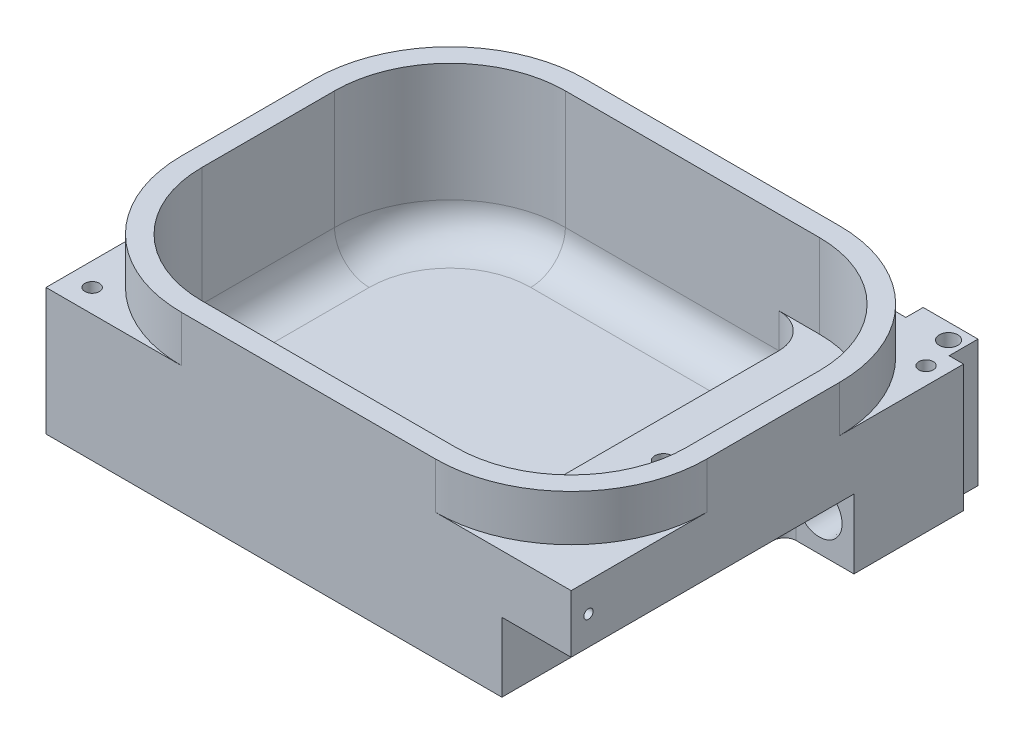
ISO-10303-21;
HEADER;
FILE_DESCRIPTION(('STEP AP214'),'2;1');
FILE_NAME('part.step','',(''),(''),'','','');
FILE_SCHEMA(('AUTOMOTIVE_DESIGN { 1 0 10303 214 1 1 1 1 }'));
ENDSEC;
DATA;
#1=APPLICATION_CONTEXT('core data for automotive mechanical design processes');
#2=APPLICATION_PROTOCOL_DEFINITION('international standard','automotive_design',2000,#1);
#3=PRODUCT_CONTEXT('',#1,'mechanical');
#4=PRODUCT('Part','Part','',(#3));
#5=PRODUCT_RELATED_PRODUCT_CATEGORY('part','',(#4));
#6=PRODUCT_DEFINITION_FORMATION('','',#4);
#7=PRODUCT_DEFINITION_CONTEXT('part definition',#1,'design');
#8=PRODUCT_DEFINITION('design','',#6,#7);
#9=PRODUCT_DEFINITION_SHAPE('','',#8);
#10=(LENGTH_UNIT() NAMED_UNIT(*) SI_UNIT(.MILLI.,.METRE.));
#11=(NAMED_UNIT(*) PLANE_ANGLE_UNIT() SI_UNIT($,.RADIAN.));
#12=(NAMED_UNIT(*) SI_UNIT($,.STERADIAN.) SOLID_ANGLE_UNIT());
#13=UNCERTAINTY_MEASURE_WITH_UNIT(LENGTH_MEASURE(1.E-05),#10,'distance_accuracy_value','');
#14=(GEOMETRIC_REPRESENTATION_CONTEXT(3) GLOBAL_UNCERTAINTY_ASSIGNED_CONTEXT((#13)) GLOBAL_UNIT_ASSIGNED_CONTEXT((#10,
#11,#12)) REPRESENTATION_CONTEXT('',''));
#15=CARTESIAN_POINT('',(0.,0.,0.));
#16=DIRECTION('',(0.,0.,1.));
#17=DIRECTION('',(1.,0.,0.));
#18=AXIS2_PLACEMENT_3D('',#15,#16,#17);
#19=CARTESIAN_POINT('',(45.5,42.,-35.));
#20=DIRECTION('',(0.,0.,1.));
#21=DIRECTION('',(1.,0.,0.));
#22=AXIS2_PLACEMENT_3D('',#19,#20,#21);
#23=PLANE('',#22);
#24=CARTESIAN_POINT('',(27.5,6.,-35.));
#25=DIRECTION('',(0.,0.,-1.));
#26=DIRECTION('',(-1.,0.,0.));
#27=AXIS2_PLACEMENT_3D('',#24,#25,#26);
#28=CIRCLE('',#27,3.175);
#29=CARTESIAN_POINT('',(24.325,6.,-35.));
#30=VERTEX_POINT('',#29);
#31=EDGE_CURVE('E417',#30,#30,#28,.T.);
#32=ORIENTED_EDGE('',*,*,#31,.F.);
#33=EDGE_LOOP('',(#32));
#34=FACE_BOUND('',#33,.T.);
#35=DIRECTION('',(0.,-1.,0.));
#36=VECTOR('',#35,1.);
#37=CARTESIAN_POINT('',(-33.5,22.,-35.));
#38=LINE('',#37,#36);
#39=CARTESIAN_POINT('',(-33.5,22.,-35.));
#40=VERTEX_POINT('',#39);
#41=CARTESIAN_POINT('',(-33.5,0.,-35.));
#42=VERTEX_POINT('',#41);
#43=EDGE_CURVE('E379',#40,#42,#38,.T.);
#44=ORIENTED_EDGE('',*,*,#43,.F.);
#45=DIRECTION('',(-1.,0.,0.));
#46=VECTOR('',#45,1.);
#47=CARTESIAN_POINT('',(0.,22.,-35.));
#48=LINE('',#47,#46);
#49=CARTESIAN_POINT('',(-22.,22.,-35.));
#50=VERTEX_POINT('',#49);
#51=EDGE_CURVE('E1451',#50,#40,#48,.T.);
#52=ORIENTED_EDGE('',*,*,#51,.F.);
#53=DIRECTION('',(0.,1.,0.));
#54=VECTOR('',#53,1.);
#55=CARTESIAN_POINT('',(-22.,22.,-35.));
#56=LINE('',#55,#54);
#57=CARTESIAN_POINT('',(-22.,30.,-35.));
#58=VERTEX_POINT('',#57);
#59=EDGE_CURVE('E1457',#50,#58,#56,.T.);
#60=ORIENTED_EDGE('',*,*,#59,.T.);
#61=DIRECTION('',(-1.,0.,0.));
#62=VECTOR('',#61,1.);
#63=CARTESIAN_POINT('',(45.5,30.,-35.));
#64=LINE('',#63,#62);
#65=CARTESIAN_POINT('',(22.,30.,-35.));
#66=VERTEX_POINT('',#65);
#67=EDGE_CURVE('E658',#66,#58,#64,.T.);
#68=ORIENTED_EDGE('',*,*,#67,.F.);
#69=DIRECTION('',(0.,1.,0.));
#70=VECTOR('',#69,1.);
#71=CARTESIAN_POINT('',(22.,22.,-35.));
#72=LINE('',#71,#70);
#73=CARTESIAN_POINT('',(22.,22.,-35.));
#74=VERTEX_POINT('',#73);
#75=EDGE_CURVE('E1452',#74,#66,#72,.T.);
#76=ORIENTED_EDGE('',*,*,#75,.F.);
#77=DIRECTION('',(-1.,0.,0.));
#78=VECTOR('',#77,1.);
#79=CARTESIAN_POINT('',(0.,22.,-35.));
#80=LINE('',#79,#78);
#81=CARTESIAN_POINT('',(33.5,22.,-35.));
#82=VERTEX_POINT('',#81);
#83=EDGE_CURVE('E1468',#82,#74,#80,.T.);
#84=ORIENTED_EDGE('',*,*,#83,.F.);
#85=DIRECTION('',(0.,1.,0.));
#86=VECTOR('',#85,1.);
#87=CARTESIAN_POINT('',(33.5,22.,-35.));
#88=LINE('',#87,#86);
#89=CARTESIAN_POINT('',(33.5,0.,-35.));
#90=VERTEX_POINT('',#89);
#91=EDGE_CURVE('E393',#90,#82,#88,.T.);
#92=ORIENTED_EDGE('',*,*,#91,.F.);
#93=DIRECTION('',(-1.,0.,0.));
#94=VECTOR('',#93,1.);
#95=CARTESIAN_POINT('',(45.5,0.,-35.));
#96=LINE('',#95,#94);
#97=EDGE_CURVE('E698',#90,#42,#96,.T.);
#98=ORIENTED_EDGE('',*,*,#97,.T.);
#99=EDGE_LOOP('',(#44,#52,#60,#68,#76,#84,#92,#98));
#100=FACE_BOUND('',#99,.T.);
#101=ADVANCED_FACE('F40',(#34,#100),#23,.F.);
#102=CARTESIAN_POINT('',(0.,30.,0.));
#103=DIRECTION('',(0.,1.,0.));
#104=DIRECTION('',(0.,0.,1.));
#105=AXIS2_PLACEMENT_3D('',#102,#103,#104);
#106=PLANE('',#105);
#107=DIRECTION('',(0.,0.,1.));
#108=VECTOR('',#107,1.);
#109=CARTESIAN_POINT('',(-42.,30.,-35.));
#110=LINE('',#109,#108);
#111=CARTESIAN_POINT('',(-42.,30.,-11.5));
#112=VERTEX_POINT('',#111);
#113=CARTESIAN_POINT('',(-42.,30.,11.5));
#114=VERTEX_POINT('',#113);
#115=EDGE_CURVE('E646',#112,#114,#110,.T.);
#116=ORIENTED_EDGE('',*,*,#115,.F.);
#117=CARTESIAN_POINT('',(-22.,30.,-11.5));
#118=DIRECTION('',(0.,1.,0.));
#119=DIRECTION('',(0.,0.,1.));
#120=AXIS2_PLACEMENT_3D('',#117,#118,#119);
#121=CIRCLE('',#120,20.);
#122=CARTESIAN_POINT('',(-22.,30.,-31.5));
#123=VERTEX_POINT('',#122);
#124=EDGE_CURVE('E664',#112,#123,#121,.F.);
#125=ORIENTED_EDGE('',*,*,#124,.T.);
#126=DIRECTION('',(-1.,0.,0.));
#127=VECTOR('',#126,1.);
#128=CARTESIAN_POINT('',(45.5,30.,-31.5));
#129=LINE('',#128,#127);
#130=CARTESIAN_POINT('',(22.,30.,-31.5));
#131=VERTEX_POINT('',#130);
#132=EDGE_CURVE('E636',#131,#123,#129,.T.);
#133=ORIENTED_EDGE('',*,*,#132,.F.);
#134=CARTESIAN_POINT('',(22.,30.,-11.5));
#135=DIRECTION('',(0.,1.,0.));
#136=DIRECTION('',(0.,0.,1.));
#137=AXIS2_PLACEMENT_3D('',#134,#135,#136);
#138=CIRCLE('',#137,20.);
#139=CARTESIAN_POINT('',(42.,30.,-11.5));
#140=VERTEX_POINT('',#139);
#141=EDGE_CURVE('E667',#131,#140,#138,.F.);
#142=ORIENTED_EDGE('',*,*,#141,.T.);
#143=DIRECTION('',(0.,0.,-1.));
#144=VECTOR('',#143,1.);
#145=CARTESIAN_POINT('',(42.,30.,-35.));
#146=LINE('',#145,#144);
#147=CARTESIAN_POINT('',(42.,30.,11.5));
#148=VERTEX_POINT('',#147);
#149=EDGE_CURVE('E640',#148,#140,#146,.T.);
#150=ORIENTED_EDGE('',*,*,#149,.F.);
#151=CARTESIAN_POINT('',(22.,30.,11.5));
#152=DIRECTION('',(0.,1.,0.));
#153=DIRECTION('',(0.,0.,1.));
#154=AXIS2_PLACEMENT_3D('',#151,#152,#153);
#155=CIRCLE('',#154,20.);
#156=CARTESIAN_POINT('',(22.,30.,31.5));
#157=VERTEX_POINT('',#156);
#158=EDGE_CURVE('E586',#148,#157,#155,.F.);
#159=ORIENTED_EDGE('',*,*,#158,.T.);
#160=DIRECTION('',(1.,0.,0.));
#161=VECTOR('',#160,1.);
#162=CARTESIAN_POINT('',(45.5,30.,31.5));
#163=LINE('',#162,#161);
#164=CARTESIAN_POINT('',(-22.,30.,31.5));
#165=VERTEX_POINT('',#164);
#166=EDGE_CURVE('E643',#165,#157,#163,.T.);
#167=ORIENTED_EDGE('',*,*,#166,.F.);
#168=CARTESIAN_POINT('',(-22.,30.,11.5));
#169=DIRECTION('',(0.,1.,0.));
#170=DIRECTION('',(0.,0.,1.));
#171=AXIS2_PLACEMENT_3D('',#168,#169,#170);
#172=CIRCLE('',#171,20.);
#173=EDGE_CURVE('E661',#165,#114,#172,.F.);
#174=ORIENTED_EDGE('',*,*,#173,.T.);
#175=EDGE_LOOP('',(#116,#125,#133,#142,#150,#159,#167,#174));
#176=FACE_BOUND('',#175,.T.);
#177=ORIENTED_EDGE('',*,*,#67,.T.);
#178=CARTESIAN_POINT('',(-22.,30.,-11.5));
#179=DIRECTION('',(0.,1.,0.));
#180=DIRECTION('',(0.,0.,1.));
#181=AXIS2_PLACEMENT_3D('',#178,#179,#180);
#182=CIRCLE('',#181,23.5);
#183=CARTESIAN_POINT('',(-45.5,30.,-11.5));
#184=VERTEX_POINT('',#183);
#185=EDGE_CURVE('E864',#58,#184,#182,.T.);
#186=ORIENTED_EDGE('',*,*,#185,.T.);
#187=DIRECTION('',(0.,0.,1.));
#188=VECTOR('',#187,1.);
#189=CARTESIAN_POINT('',(-45.5,30.,-35.));
#190=LINE('',#189,#188);
#191=CARTESIAN_POINT('',(-45.5,30.,11.5));
#192=VERTEX_POINT('',#191);
#193=EDGE_CURVE('E649',#184,#192,#190,.T.);
#194=ORIENTED_EDGE('',*,*,#193,.T.);
#195=CARTESIAN_POINT('',(-22.,30.,11.5));
#196=DIRECTION('',(0.,1.,0.));
#197=DIRECTION('',(0.,0.,1.));
#198=AXIS2_PLACEMENT_3D('',#195,#196,#197);
#199=CIRCLE('',#198,23.5);
#200=CARTESIAN_POINT('',(-22.,30.,35.));
#201=VERTEX_POINT('',#200);
#202=EDGE_CURVE('E871',#192,#201,#199,.T.);
#203=ORIENTED_EDGE('',*,*,#202,.T.);
#204=DIRECTION('',(1.,0.,0.));
#205=VECTOR('',#204,1.);
#206=CARTESIAN_POINT('',(45.5,30.,35.));
#207=LINE('',#206,#205);
#208=CARTESIAN_POINT('',(22.,30.,35.));
#209=VERTEX_POINT('',#208);
#210=EDGE_CURVE('E652',#201,#209,#207,.T.);
#211=ORIENTED_EDGE('',*,*,#210,.T.);
#212=CARTESIAN_POINT('',(22.,30.,11.5));
#213=DIRECTION('',(0.,1.,0.));
#214=DIRECTION('',(0.,0.,1.));
#215=AXIS2_PLACEMENT_3D('',#212,#213,#214);
#216=CIRCLE('',#215,23.5);
#217=CARTESIAN_POINT('',(45.5,30.,11.5));
#218=VERTEX_POINT('',#217);
#219=EDGE_CURVE('E868',#209,#218,#216,.T.);
#220=ORIENTED_EDGE('',*,*,#219,.T.);
#221=DIRECTION('',(0.,0.,-1.));
#222=VECTOR('',#221,1.);
#223=CARTESIAN_POINT('',(45.5,30.,-35.));
#224=LINE('',#223,#222);
#225=CARTESIAN_POINT('',(45.5,30.,-11.5));
#226=VERTEX_POINT('',#225);
#227=EDGE_CURVE('E655',#218,#226,#224,.T.);
#228=ORIENTED_EDGE('',*,*,#227,.T.);
#229=CARTESIAN_POINT('',(22.,30.,-11.5));
#230=DIRECTION('',(0.,1.,0.));
#231=DIRECTION('',(0.,0.,1.));
#232=AXIS2_PLACEMENT_3D('',#229,#230,#231);
#233=CIRCLE('',#232,23.5);
#234=EDGE_CURVE('E861',#226,#66,#233,.T.);
#235=ORIENTED_EDGE('',*,*,#234,.T.);
#236=EDGE_LOOP('',(#177,#186,#194,#203,#211,#220,#228,#235));
#237=FACE_BOUND('',#236,.T.);
#238=ADVANCED_FACE('F498',(#176,#237),#106,.T.);
#239=CARTESIAN_POINT('',(-45.5,42.,-35.));
#240=DIRECTION('',(1.,0.,0.));
#241=DIRECTION('',(0.,0.,-1.));
#242=AXIS2_PLACEMENT_3D('',#239,#240,#241);
#243=PLANE('',#242);
#244=DIRECTION('',(0.,0.,1.));
#245=VECTOR('',#244,1.);
#246=CARTESIAN_POINT('',(-45.5,22.,0.));
#247=LINE('',#246,#245);
#248=CARTESIAN_POINT('',(-45.5,22.,-33.));
#249=VERTEX_POINT('',#248);
#250=CARTESIAN_POINT('',(-45.5,22.,-11.5));
#251=VERTEX_POINT('',#250);
#252=EDGE_CURVE('E1455',#249,#251,#247,.T.);
#253=ORIENTED_EDGE('',*,*,#252,.F.);
#254=DIRECTION('',(0.,-1.,0.));
#255=VECTOR('',#254,1.);
#256=CARTESIAN_POINT('',(-45.5,42.000025,-33.));
#257=LINE('',#256,#255);
#258=CARTESIAN_POINT('',(-45.5,0.,-33.));
#259=VERTEX_POINT('',#258);
#260=EDGE_CURVE('E337',#249,#259,#257,.T.);
#261=ORIENTED_EDGE('',*,*,#260,.T.);
#262=DIRECTION('',(0.,0.,1.));
#263=VECTOR('',#262,1.);
#264=CARTESIAN_POINT('',(-45.5,0.,-35.));
#265=LINE('',#264,#263);
#266=CARTESIAN_POINT('',(-45.5,0.,35.));
#267=VERTEX_POINT('',#266);
#268=EDGE_CURVE('E817',#259,#267,#265,.T.);
#269=ORIENTED_EDGE('',*,*,#268,.T.);
#270=DIRECTION('',(0.,-1.,0.));
#271=VECTOR('',#270,1.);
#272=CARTESIAN_POINT('',(-45.5,42.,35.));
#273=LINE('',#272,#271);
#274=CARTESIAN_POINT('',(-45.5,22.,35.));
#275=VERTEX_POINT('',#274);
#276=EDGE_CURVE('E692',#275,#267,#273,.T.);
#277=ORIENTED_EDGE('',*,*,#276,.F.);
#278=DIRECTION('',(0.,0.,1.));
#279=VECTOR('',#278,1.);
#280=CARTESIAN_POINT('',(-45.5,22.,0.));
#281=LINE('',#280,#279);
#282=CARTESIAN_POINT('',(-45.5,22.,11.5));
#283=VERTEX_POINT('',#282);
#284=EDGE_CURVE('E851',#283,#275,#281,.T.);
#285=ORIENTED_EDGE('',*,*,#284,.F.);
#286=DIRECTION('',(0.,1.,0.));
#287=VECTOR('',#286,1.);
#288=CARTESIAN_POINT('',(-45.5,22.,11.5));
#289=LINE('',#288,#287);
#290=EDGE_CURVE('E850',#283,#192,#289,.T.);
#291=ORIENTED_EDGE('',*,*,#290,.T.);
#292=ORIENTED_EDGE('',*,*,#193,.F.);
#293=DIRECTION('',(0.,1.,0.));
#294=VECTOR('',#293,1.);
#295=CARTESIAN_POINT('',(-45.5,22.,-11.5));
#296=LINE('',#295,#294);
#297=EDGE_CURVE('E865',#251,#184,#296,.T.);
#298=ORIENTED_EDGE('',*,*,#297,.F.);
#299=EDGE_LOOP('',(#253,#261,#269,#277,#285,#291,#292,#298));
#300=FACE_BOUND('',#299,.T.);
#301=ADVANCED_FACE('F504',(#300),#243,.F.);
#302=CARTESIAN_POINT('',(45.5,42.,35.));
#303=DIRECTION('',(0.,0.,-1.));
#304=DIRECTION('',(-1.,0.,0.));
#305=AXIS2_PLACEMENT_3D('',#302,#303,#304);
#306=PLANE('',#305);
#307=DIRECTION('',(1.,0.,0.));
#308=VECTOR('',#307,1.);
#309=CARTESIAN_POINT('',(0.,22.,35.));
#310=LINE('',#309,#308);
#311=CARTESIAN_POINT('',(22.,22.,35.));
#312=VERTEX_POINT('',#311);
#313=CARTESIAN_POINT('',(45.5,22.,35.));
#314=VERTEX_POINT('',#313);
#315=EDGE_CURVE('E1475',#312,#314,#310,.T.);
#316=ORIENTED_EDGE('',*,*,#315,.F.);
#317=DIRECTION('',(0.,1.,0.));
#318=VECTOR('',#317,1.);
#319=CARTESIAN_POINT('',(22.,22.,35.));
#320=LINE('',#319,#318);
#321=EDGE_CURVE('E1480',#312,#209,#320,.T.);
#322=ORIENTED_EDGE('',*,*,#321,.T.);
#323=ORIENTED_EDGE('',*,*,#210,.F.);
#324=DIRECTION('',(0.,1.,0.));
#325=VECTOR('',#324,1.);
#326=CARTESIAN_POINT('',(-22.,22.,35.));
#327=LINE('',#326,#325);
#328=CARTESIAN_POINT('',(-22.,22.,35.));
#329=VERTEX_POINT('',#328);
#330=EDGE_CURVE('E847',#329,#201,#327,.T.);
#331=ORIENTED_EDGE('',*,*,#330,.F.);
#332=DIRECTION('',(1.,0.,0.));
#333=VECTOR('',#332,1.);
#334=CARTESIAN_POINT('',(0.,22.,35.));
#335=LINE('',#334,#333);
#336=EDGE_CURVE('E845',#275,#329,#335,.T.);
#337=ORIENTED_EDGE('',*,*,#336,.F.);
#338=ORIENTED_EDGE('',*,*,#276,.T.);
#339=DIRECTION('',(1.,0.,0.));
#340=VECTOR('',#339,1.);
#341=CARTESIAN_POINT('',(45.5,0.,35.));
#342=LINE('',#341,#340);
#343=CARTESIAN_POINT('',(33.5,0.,35.));
#344=VERTEX_POINT('',#343);
#345=EDGE_CURVE('E814',#267,#344,#342,.T.);
#346=ORIENTED_EDGE('',*,*,#345,.T.);
#347=DIRECTION('',(0.,-1.,0.));
#348=VECTOR('',#347,1.);
#349=CARTESIAN_POINT('',(33.5,0.,35.));
#350=LINE('',#349,#348);
#351=CARTESIAN_POINT('',(33.5,12.,35.));
#352=VERTEX_POINT('',#351);
#353=EDGE_CURVE('E625',#352,#344,#350,.T.);
#354=ORIENTED_EDGE('',*,*,#353,.F.);
#355=DIRECTION('',(-1.,0.,0.));
#356=VECTOR('',#355,1.);
#357=CARTESIAN_POINT('',(45.5,12.,35.));
#358=LINE('',#357,#356);
#359=CARTESIAN_POINT('',(45.5,12.,35.));
#360=VERTEX_POINT('',#359);
#361=EDGE_CURVE('E635',#360,#352,#358,.T.);
#362=ORIENTED_EDGE('',*,*,#361,.F.);
#363=DIRECTION('',(0.,-1.,0.));
#364=VECTOR('',#363,1.);
#365=CARTESIAN_POINT('',(45.5,42.,35.));
#366=LINE('',#365,#364);
#367=EDGE_CURVE('E695',#314,#360,#366,.T.);
#368=ORIENTED_EDGE('',*,*,#367,.F.);
#369=EDGE_LOOP('',(#316,#322,#323,#331,#337,#338,#346,#354,#362,#368));
#370=FACE_BOUND('',#369,.T.);
#371=ADVANCED_FACE('F829',(#370),#306,.F.);
#372=CARTESIAN_POINT('',(45.5,42.,-35.));
#373=DIRECTION('',(-1.,0.,0.));
#374=DIRECTION('',(0.,0.,1.));
#375=AXIS2_PLACEMENT_3D('',#372,#373,#374);
#376=PLANE('',#375);
#377=CARTESIAN_POINT('',(45.5,17.,32.));
#378=DIRECTION('',(1.,0.,0.));
#379=DIRECTION('',(0.,0.,-1.));
#380=AXIS2_PLACEMENT_3D('',#377,#378,#379);
#381=CIRCLE('',#380,0.799999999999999);
#382=CARTESIAN_POINT('',(45.5,17.,31.2));
#383=VERTEX_POINT('',#382);
#384=EDGE_CURVE('E315',#383,#383,#381,.T.);
#385=ORIENTED_EDGE('',*,*,#384,.F.);
#386=EDGE_LOOP('',(#385));
#387=FACE_BOUND('',#386,.T.);
#388=DIRECTION('',(0.,0.,-1.));
#389=VECTOR('',#388,1.);
#390=CARTESIAN_POINT('',(45.5,0.,-35.));
#391=LINE('',#390,#389);
#392=CARTESIAN_POINT('',(45.5,0.,-14.));
#393=VERTEX_POINT('',#392);
#394=CARTESIAN_POINT('',(45.5,0.,-33.));
#395=VERTEX_POINT('',#394);
#396=EDGE_CURVE('E811',#393,#395,#391,.T.);
#397=ORIENTED_EDGE('',*,*,#396,.T.);
#398=DIRECTION('',(0.,-1.,0.));
#399=VECTOR('',#398,1.);
#400=CARTESIAN_POINT('',(45.5,42.000025,-33.));
#401=LINE('',#400,#399);
#402=CARTESIAN_POINT('',(45.5,22.,-33.));
#403=VERTEX_POINT('',#402);
#404=EDGE_CURVE('E325',#403,#395,#401,.T.);
#405=ORIENTED_EDGE('',*,*,#404,.F.);
#406=DIRECTION('',(0.,0.,-1.));
#407=VECTOR('',#406,1.);
#408=CARTESIAN_POINT('',(45.5,22.,0.));
#409=LINE('',#408,#407);
#410=CARTESIAN_POINT('',(45.5,22.,-11.5));
#411=VERTEX_POINT('',#410);
#412=EDGE_CURVE('E1464',#411,#403,#409,.T.);
#413=ORIENTED_EDGE('',*,*,#412,.F.);
#414=DIRECTION('',(0.,1.,0.));
#415=VECTOR('',#414,1.);
#416=CARTESIAN_POINT('',(45.5,22.,-11.5));
#417=LINE('',#416,#415);
#418=EDGE_CURVE('E1470',#411,#226,#417,.T.);
#419=ORIENTED_EDGE('',*,*,#418,.T.);
#420=ORIENTED_EDGE('',*,*,#227,.F.);
#421=DIRECTION('',(0.,1.,0.));
#422=VECTOR('',#421,1.);
#423=CARTESIAN_POINT('',(45.5,22.,11.5));
#424=LINE('',#423,#422);
#425=CARTESIAN_POINT('',(45.5,22.,11.5));
#426=VERTEX_POINT('',#425);
#427=EDGE_CURVE('E1465',#426,#218,#424,.T.);
#428=ORIENTED_EDGE('',*,*,#427,.F.);
#429=DIRECTION('',(0.,0.,-1.));
#430=VECTOR('',#429,1.);
#431=CARTESIAN_POINT('',(45.5,22.,0.));
#432=LINE('',#431,#430);
#433=EDGE_CURVE('E1477',#314,#426,#432,.T.);
#434=ORIENTED_EDGE('',*,*,#433,.F.);
#435=ORIENTED_EDGE('',*,*,#367,.T.);
#436=DIRECTION('',(0.,0.,1.));
#437=VECTOR('',#436,1.);
#438=CARTESIAN_POINT('',(45.5,12.,-14.));
#439=LINE('',#438,#437);
#440=CARTESIAN_POINT('',(45.5,12.,-14.));
#441=VERTEX_POINT('',#440);
#442=EDGE_CURVE('E627',#441,#360,#439,.T.);
#443=ORIENTED_EDGE('',*,*,#442,.F.);
#444=DIRECTION('',(0.,1.,0.));
#445=VECTOR('',#444,1.);
#446=CARTESIAN_POINT('',(45.5,0.,-14.));
#447=LINE('',#446,#445);
#448=EDGE_CURVE('E621',#393,#441,#447,.T.);
#449=ORIENTED_EDGE('',*,*,#448,.F.);
#450=EDGE_LOOP('',(#397,#405,#413,#419,#420,#428,#434,#435,#443,#449));
#451=FACE_BOUND('',#450,.T.);
#452=ADVANCED_FACE('F511',(#387,#451),#376,.F.);
#453=CARTESIAN_POINT('',(-42.,42.,-35.));
#454=DIRECTION('',(1.,0.,0.));
#455=DIRECTION('',(0.,0.,-1.));
#456=AXIS2_PLACEMENT_3D('',#453,#454,#455);
#457=PLANE('',#456);
#458=DIRECTION('',(0.,-1.,0.));
#459=VECTOR('',#458,1.);
#460=CARTESIAN_POINT('',(-42.,3.5,11.5));
#461=LINE('',#460,#459);
#462=CARTESIAN_POINT('',(-42.,9.5,11.5));
#463=VERTEX_POINT('',#462);
#464=EDGE_CURVE('E686',#114,#463,#461,.T.);
#465=ORIENTED_EDGE('',*,*,#464,.T.);
#466=DIRECTION('',(0.,0.,1.));
#467=VECTOR('',#466,1.);
#468=CARTESIAN_POINT('',(-42.,9.5,-35.));
#469=LINE('',#468,#467);
#470=CARTESIAN_POINT('',(-42.,9.5,-11.5));
#471=VERTEX_POINT('',#470);
#472=EDGE_CURVE('E717',#463,#471,#469,.F.);
#473=ORIENTED_EDGE('',*,*,#472,.T.);
#474=DIRECTION('',(0.,-1.,0.));
#475=VECTOR('',#474,1.);
#476=CARTESIAN_POINT('',(-42.,38.5,-11.5));
#477=LINE('',#476,#475);
#478=EDGE_CURVE('E689',#471,#112,#477,.F.);
#479=ORIENTED_EDGE('',*,*,#478,.T.);
#480=ORIENTED_EDGE('',*,*,#115,.T.);
#481=EDGE_LOOP('',(#465,#473,#479,#480));
#482=FACE_BOUND('',#481,.T.);
#483=ADVANCED_FACE('F934',(#482),#457,.T.);
#484=CARTESIAN_POINT('',(45.5,42.,31.5));
#485=DIRECTION('',(0.,0.,-1.));
#486=DIRECTION('',(-1.,0.,0.));
#487=AXIS2_PLACEMENT_3D('',#484,#485,#486);
#488=PLANE('',#487);
#489=DIRECTION('',(0.,1.,0.));
#490=VECTOR('',#489,1.);
#491=CARTESIAN_POINT('',(15.,3.5,31.5));
#492=LINE('',#491,#490);
#493=CARTESIAN_POINT('',(15.,15.5,31.5));
#494=VERTEX_POINT('',#493);
#495=CARTESIAN_POINT('',(15.,9.5,31.5));
#496=VERTEX_POINT('',#495);
#497=EDGE_CURVE('E710',#494,#496,#492,.F.);
#498=ORIENTED_EDGE('',*,*,#497,.T.);
#499=DIRECTION('',(1.,0.,0.));
#500=VECTOR('',#499,1.);
#501=CARTESIAN_POINT('',(45.5,9.5,31.5));
#502=LINE('',#501,#500);
#503=CARTESIAN_POINT('',(-22.,9.5,31.5));
#504=VERTEX_POINT('',#503);
#505=EDGE_CURVE('E712',#496,#504,#502,.F.);
#506=ORIENTED_EDGE('',*,*,#505,.T.);
#507=DIRECTION('',(0.,-1.,0.));
#508=VECTOR('',#507,1.);
#509=CARTESIAN_POINT('',(-22.,38.5,31.5));
#510=LINE('',#509,#508);
#511=EDGE_CURVE('E682',#504,#165,#510,.F.);
#512=ORIENTED_EDGE('',*,*,#511,.T.);
#513=ORIENTED_EDGE('',*,*,#166,.T.);
#514=DIRECTION('',(0.,-1.,0.));
#515=VECTOR('',#514,1.);
#516=CARTESIAN_POINT('',(22.,15.5,31.5));
#517=LINE('',#516,#515);
#518=CARTESIAN_POINT('',(22.,15.5,31.5));
#519=VERTEX_POINT('',#518);
#520=EDGE_CURVE('E684',#157,#519,#517,.T.);
#521=ORIENTED_EDGE('',*,*,#520,.T.);
#522=DIRECTION('',(-1.,0.,0.));
#523=VECTOR('',#522,1.);
#524=CARTESIAN_POINT('',(45.5,15.5,31.5));
#525=LINE('',#524,#523);
#526=EDGE_CURVE('E691',#519,#494,#525,.T.);
#527=ORIENTED_EDGE('',*,*,#526,.T.);
#528=EDGE_LOOP('',(#498,#506,#512,#513,#521,#527));
#529=FACE_BOUND('',#528,.T.);
#530=ADVANCED_FACE('F787',(#529),#488,.T.);
#531=CARTESIAN_POINT('',(42.,42.,-35.));
#532=DIRECTION('',(-1.,0.,0.));
#533=DIRECTION('',(0.,0.,1.));
#534=AXIS2_PLACEMENT_3D('',#531,#532,#533);
#535=PLANE('',#534);
#536=DIRECTION('',(0.,-1.,0.));
#537=VECTOR('',#536,1.);
#538=CARTESIAN_POINT('',(42.,38.5,11.5));
#539=LINE('',#538,#537);
#540=CARTESIAN_POINT('',(42.,15.5,11.5));
#541=VERTEX_POINT('',#540);
#542=EDGE_CURVE('E674',#541,#148,#539,.F.);
#543=ORIENTED_EDGE('',*,*,#542,.T.);
#544=ORIENTED_EDGE('',*,*,#149,.T.);
#545=DIRECTION('',(0.,-1.,0.));
#546=VECTOR('',#545,1.);
#547=CARTESIAN_POINT('',(42.,15.5,-11.5));
#548=LINE('',#547,#546);
#549=CARTESIAN_POINT('',(42.,15.5,-11.5));
#550=VERTEX_POINT('',#549);
#551=EDGE_CURVE('E672',#140,#550,#548,.T.);
#552=ORIENTED_EDGE('',*,*,#551,.T.);
#553=DIRECTION('',(0.,0.,1.));
#554=VECTOR('',#553,1.);
#555=CARTESIAN_POINT('',(42.,15.5,-14.));
#556=LINE('',#555,#554);
#557=EDGE_CURVE('E806',#550,#541,#556,.T.);
#558=ORIENTED_EDGE('',*,*,#557,.T.);
#559=EDGE_LOOP('',(#543,#544,#552,#558));
#560=FACE_BOUND('',#559,.T.);
#561=ADVANCED_FACE('F933',(#560),#535,.T.);
#562=CARTESIAN_POINT('',(45.5,42.,-31.5));
#563=DIRECTION('',(0.,0.,1.));
#564=DIRECTION('',(1.,0.,0.));
#565=AXIS2_PLACEMENT_3D('',#562,#563,#564);
#566=PLANE('',#565);
#567=DIRECTION('',(0.,-1.,0.));
#568=VECTOR('',#567,1.);
#569=CARTESIAN_POINT('',(-22.,3.5,-31.5));
#570=LINE('',#569,#568);
#571=CARTESIAN_POINT('',(-22.,9.5,-31.5));
#572=VERTEX_POINT('',#571);
#573=EDGE_CURVE('E677',#123,#572,#570,.T.);
#574=ORIENTED_EDGE('',*,*,#573,.T.);
#575=DIRECTION('',(-1.,0.,0.));
#576=VECTOR('',#575,1.);
#577=CARTESIAN_POINT('',(45.5,9.5,-31.5));
#578=LINE('',#577,#576);
#579=CARTESIAN_POINT('',(15.,9.5,-31.5));
#580=VERTEX_POINT('',#579);
#581=EDGE_CURVE('E566',#572,#580,#578,.F.);
#582=ORIENTED_EDGE('',*,*,#581,.T.);
#583=DIRECTION('',(0.,-1.,0.));
#584=VECTOR('',#583,1.);
#585=CARTESIAN_POINT('',(15.,15.5,-31.5));
#586=LINE('',#585,#584);
#587=CARTESIAN_POINT('',(15.,15.5,-31.5));
#588=VERTEX_POINT('',#587);
#589=EDGE_CURVE('E721',#580,#588,#586,.F.);
#590=ORIENTED_EDGE('',*,*,#589,.T.);
#591=DIRECTION('',(-1.,0.,0.));
#592=VECTOR('',#591,1.);
#593=CARTESIAN_POINT('',(45.5,15.5,-31.5));
#594=LINE('',#593,#592);
#595=CARTESIAN_POINT('',(22.,15.5,-31.5));
#596=VERTEX_POINT('',#595);
#597=EDGE_CURVE('E696',#596,#588,#594,.T.);
#598=ORIENTED_EDGE('',*,*,#597,.F.);
#599=DIRECTION('',(0.,-1.,0.));
#600=VECTOR('',#599,1.);
#601=CARTESIAN_POINT('',(22.,38.5,-31.5));
#602=LINE('',#601,#600);
#603=EDGE_CURVE('E680',#596,#131,#602,.F.);
#604=ORIENTED_EDGE('',*,*,#603,.T.);
#605=ORIENTED_EDGE('',*,*,#132,.T.);
#606=EDGE_LOOP('',(#574,#582,#590,#598,#604,#605));
#607=FACE_BOUND('',#606,.T.);
#608=ADVANCED_FACE('F765',(#607),#566,.T.);
#609=CARTESIAN_POINT('',(-22.,42.,11.5));
#610=DIRECTION('',(0.,1.,0.));
#611=DIRECTION('',(0.,0.,1.));
#612=AXIS2_PLACEMENT_3D('',#609,#610,#611);
#613=CYLINDRICAL_SURFACE('',#612,20.);
#614=ORIENTED_EDGE('',*,*,#511,.F.);
#615=CARTESIAN_POINT('',(-22.,9.5,11.5));
#616=DIRECTION('',(0.,-1.,0.));
#617=DIRECTION('',(0.,0.,-1.));
#618=AXIS2_PLACEMENT_3D('',#615,#616,#617);
#619=CIRCLE('',#618,20.);
#620=EDGE_CURVE('E715',#504,#463,#619,.T.);
#621=ORIENTED_EDGE('',*,*,#620,.T.);
#622=ORIENTED_EDGE('',*,*,#464,.F.);
#623=ORIENTED_EDGE('',*,*,#173,.F.);
#624=EDGE_LOOP('',(#614,#621,#622,#623));
#625=FACE_BOUND('',#624,.T.);
#626=ADVANCED_FACE('F791',(#625),#613,.F.);
#627=CARTESIAN_POINT('',(-22.,42.,-11.5));
#628=DIRECTION('',(0.,1.,0.));
#629=DIRECTION('',(0.,0.,1.));
#630=AXIS2_PLACEMENT_3D('',#627,#628,#629);
#631=CYLINDRICAL_SURFACE('',#630,20.);
#632=ORIENTED_EDGE('',*,*,#478,.F.);
#633=CARTESIAN_POINT('',(-22.,9.5,-11.5));
#634=DIRECTION('',(0.,-1.,0.));
#635=DIRECTION('',(0.,0.,-1.));
#636=AXIS2_PLACEMENT_3D('',#633,#634,#635);
#637=CIRCLE('',#636,20.);
#638=EDGE_CURVE('E719',#471,#572,#637,.T.);
#639=ORIENTED_EDGE('',*,*,#638,.T.);
#640=ORIENTED_EDGE('',*,*,#573,.F.);
#641=ORIENTED_EDGE('',*,*,#124,.F.);
#642=EDGE_LOOP('',(#632,#639,#640,#641));
#643=FACE_BOUND('',#642,.T.);
#644=ADVANCED_FACE('F771',(#643),#631,.F.);
#645=CARTESIAN_POINT('',(22.,42.,-11.5));
#646=DIRECTION('',(0.,1.,0.));
#647=DIRECTION('',(0.,0.,1.));
#648=AXIS2_PLACEMENT_3D('',#645,#646,#647);
#649=CYLINDRICAL_SURFACE('',#648,20.);
#650=ORIENTED_EDGE('',*,*,#141,.F.);
#651=ORIENTED_EDGE('',*,*,#603,.F.);
#652=CARTESIAN_POINT('',(22.,15.5,-11.5));
#653=DIRECTION('',(0.,1.,0.));
#654=DIRECTION('',(-1.,0.,0.));
#655=AXIS2_PLACEMENT_3D('',#652,#653,#654);
#656=CIRCLE('',#655,20.);
#657=EDGE_CURVE('E639',#550,#596,#656,.T.);
#658=ORIENTED_EDGE('',*,*,#657,.F.);
#659=ORIENTED_EDGE('',*,*,#551,.F.);
#660=EDGE_LOOP('',(#650,#651,#658,#659));
#661=FACE_BOUND('',#660,.T.);
#662=ADVANCED_FACE('F940',(#661),#649,.F.);
#663=CARTESIAN_POINT('',(22.,42.,11.5));
#664=DIRECTION('',(0.,1.,0.));
#665=DIRECTION('',(0.,0.,1.));
#666=AXIS2_PLACEMENT_3D('',#663,#664,#665);
#667=CYLINDRICAL_SURFACE('',#666,20.);
#668=ORIENTED_EDGE('',*,*,#158,.F.);
#669=ORIENTED_EDGE('',*,*,#542,.F.);
#670=CARTESIAN_POINT('',(22.,15.5,11.5));
#671=DIRECTION('',(0.,1.,0.));
#672=DIRECTION('',(-1.,0.,0.));
#673=AXIS2_PLACEMENT_3D('',#670,#671,#672);
#674=CIRCLE('',#673,20.);
#675=EDGE_CURVE('E675',#519,#541,#674,.T.);
#676=ORIENTED_EDGE('',*,*,#675,.F.);
#677=ORIENTED_EDGE('',*,*,#520,.F.);
#678=EDGE_LOOP('',(#668,#669,#676,#677));
#679=FACE_BOUND('',#678,.T.);
#680=ADVANCED_FACE('F799',(#679),#667,.F.);
#681=CARTESIAN_POINT('',(0.,3.5,0.));
#682=DIRECTION('',(0.,-1.,0.));
#683=DIRECTION('',(0.,0.,-1.));
#684=AXIS2_PLACEMENT_3D('',#681,#682,#683);
#685=PLANE('',#684);
#686=CARTESIAN_POINT('',(-22.,3.5,11.5));
#687=DIRECTION('',(0.,-1.,0.));
#688=DIRECTION('',(0.,0.,-1.));
#689=AXIS2_PLACEMENT_3D('',#686,#687,#688);
#690=CIRCLE('',#689,14.);
#691=CARTESIAN_POINT('',(-36.,3.5,11.5));
#692=VERTEX_POINT('',#691);
#693=CARTESIAN_POINT('',(-22.,3.5,25.5));
#694=VERTEX_POINT('',#693);
#695=EDGE_CURVE('E705',#692,#694,#690,.F.);
#696=ORIENTED_EDGE('',*,*,#695,.T.);
#697=DIRECTION('',(1.,0.,0.));
#698=VECTOR('',#697,1.);
#699=CARTESIAN_POINT('',(0.,3.5,25.5));
#700=LINE('',#699,#698);
#701=CARTESIAN_POINT('',(15.,3.5,25.5));
#702=VERTEX_POINT('',#701);
#703=EDGE_CURVE('E707',#694,#702,#700,.T.);
#704=ORIENTED_EDGE('',*,*,#703,.T.);
#705=DIRECTION('',(0.,0.,-1.));
#706=VECTOR('',#705,1.);
#707=CARTESIAN_POINT('',(15.,3.5,0.));
#708=LINE('',#707,#706);
#709=CARTESIAN_POINT('',(15.,3.5,-25.5));
#710=VERTEX_POINT('',#709);
#711=EDGE_CURVE('E634',#702,#710,#708,.T.);
#712=ORIENTED_EDGE('',*,*,#711,.T.);
#713=DIRECTION('',(-1.,0.,0.));
#714=VECTOR('',#713,1.);
#715=CARTESIAN_POINT('',(0.,3.5,-25.5));
#716=LINE('',#715,#714);
#717=CARTESIAN_POINT('',(-22.,3.5,-25.5));
#718=VERTEX_POINT('',#717);
#719=EDGE_CURVE('E568',#710,#718,#716,.T.);
#720=ORIENTED_EDGE('',*,*,#719,.T.);
#721=CARTESIAN_POINT('',(-22.,3.5,-11.5));
#722=DIRECTION('',(0.,-1.,0.));
#723=DIRECTION('',(0.,0.,-1.));
#724=AXIS2_PLACEMENT_3D('',#721,#722,#723);
#725=CIRCLE('',#724,14.);
#726=CARTESIAN_POINT('',(-36.,3.5,-11.5));
#727=VERTEX_POINT('',#726);
#728=EDGE_CURVE('E701',#718,#727,#725,.F.);
#729=ORIENTED_EDGE('',*,*,#728,.T.);
#730=DIRECTION('',(0.,0.,1.));
#731=VECTOR('',#730,1.);
#732=CARTESIAN_POINT('',(-36.,3.5,0.));
#733=LINE('',#732,#731);
#734=EDGE_CURVE('E703',#727,#692,#733,.T.);
#735=ORIENTED_EDGE('',*,*,#734,.T.);
#736=EDGE_LOOP('',(#696,#704,#712,#720,#729,#735));
#737=FACE_BOUND('',#736,.T.);
#738=ADVANCED_FACE('F780',(#737),#685,.F.);
#739=CARTESIAN_POINT('',(45.5,15.5,-14.));
#740=DIRECTION('',(0.,1.,0.));
#741=DIRECTION('',(-1.,0.,0.));
#742=AXIS2_PLACEMENT_3D('',#739,#740,#741);
#743=PLANE('',#742);
#744=CARTESIAN_POINT('',(30.,15.5,-22.2));
#745=DIRECTION('',(0.,1.,0.));
#746=DIRECTION('',(1.,0.,0.));
#747=AXIS2_PLACEMENT_3D('',#744,#745,#746);
#748=ELLIPSE('',#747,2.12132034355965,1.5);
#749=CARTESIAN_POINT('',(32.1213203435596,15.5,-22.2));
#750=VERTEX_POINT('',#749);
#751=EDGE_CURVE('E1566',#750,#750,#748,.F.);
#752=ORIENTED_EDGE('',*,*,#751,.T.);
#753=EDGE_LOOP('',(#752));
#754=FACE_BOUND('',#753,.T.);
#755=CARTESIAN_POINT('',(27.5,15.5,0.999999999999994));
#756=DIRECTION('',(0.,1.,0.));
#757=DIRECTION('',(0.,0.,1.));
#758=AXIS2_PLACEMENT_3D('',#755,#756,#757);
#759=CIRCLE('',#758,1.49999999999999);
#760=CARTESIAN_POINT('',(27.5,15.5,2.49999999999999));
#761=VERTEX_POINT('',#760);
#762=EDGE_CURVE('E407',#761,#761,#759,.T.);
#763=ORIENTED_EDGE('',*,*,#762,.F.);
#764=EDGE_LOOP('',(#763));
#765=FACE_BOUND('',#764,.T.);
#766=ORIENTED_EDGE('',*,*,#557,.F.);
#767=ORIENTED_EDGE('',*,*,#657,.T.);
#768=ORIENTED_EDGE('',*,*,#597,.T.);
#769=CARTESIAN_POINT('',(15.,15.5,-25.5));
#770=DIRECTION('',(0.,1.,0.));
#771=DIRECTION('',(-1.,0.,0.));
#772=AXIS2_PLACEMENT_3D('',#769,#770,#771);
#773=CIRCLE('',#772,6.);
#774=CARTESIAN_POINT('',(21.,15.5,-25.5));
#775=VERTEX_POINT('',#774);
#776=EDGE_CURVE('E731',#588,#775,#773,.F.);
#777=ORIENTED_EDGE('',*,*,#776,.T.);
#778=DIRECTION('',(0.,0.,-1.));
#779=VECTOR('',#778,1.);
#780=CARTESIAN_POINT('',(21.,15.5,50.));
#781=LINE('',#780,#779);
#782=CARTESIAN_POINT('',(21.,15.5,25.5));
#783=VERTEX_POINT('',#782);
#784=EDGE_CURVE('E631',#783,#775,#781,.T.);
#785=ORIENTED_EDGE('',*,*,#784,.F.);
#786=CARTESIAN_POINT('',(15.,15.5,25.5));
#787=DIRECTION('',(0.,1.,0.));
#788=DIRECTION('',(-1.,0.,0.));
#789=AXIS2_PLACEMENT_3D('',#786,#787,#788);
#790=CIRCLE('',#789,6.);
#791=EDGE_CURVE('E600',#783,#494,#790,.F.);
#792=ORIENTED_EDGE('',*,*,#791,.T.);
#793=ORIENTED_EDGE('',*,*,#526,.F.);
#794=ORIENTED_EDGE('',*,*,#675,.T.);
#795=EDGE_LOOP('',(#766,#767,#768,#777,#785,#792,#793,#794));
#796=FACE_BOUND('',#795,.T.);
#797=ADVANCED_FACE('F761',(#754,#765,#796),#743,.T.);
#798=CARTESIAN_POINT('',(21.,15.5,50.));
#799=DIRECTION('',(-1.,0.,0.));
#800=DIRECTION('',(0.,0.,1.));
#801=AXIS2_PLACEMENT_3D('',#798,#799,#800);
#802=PLANE('',#801);
#803=ORIENTED_EDGE('',*,*,#784,.T.);
#804=DIRECTION('',(0.,-1.,0.));
#805=VECTOR('',#804,1.);
#806=CARTESIAN_POINT('',(21.,3.5,-25.5));
#807=LINE('',#806,#805);
#808=CARTESIAN_POINT('',(21.,9.5,-25.5));
#809=VERTEX_POINT('',#808);
#810=EDGE_CURVE('E729',#775,#809,#807,.T.);
#811=ORIENTED_EDGE('',*,*,#810,.T.);
#812=DIRECTION('',(0.,0.,-1.));
#813=VECTOR('',#812,1.);
#814=CARTESIAN_POINT('',(21.,9.5,50.));
#815=LINE('',#814,#813);
#816=CARTESIAN_POINT('',(21.,9.5,25.5));
#817=VERTEX_POINT('',#816);
#818=EDGE_CURVE('E727',#809,#817,#815,.F.);
#819=ORIENTED_EDGE('',*,*,#818,.T.);
#820=DIRECTION('',(0.,1.,0.));
#821=VECTOR('',#820,1.);
#822=CARTESIAN_POINT('',(21.,15.5,25.5));
#823=LINE('',#822,#821);
#824=EDGE_CURVE('E725',#817,#783,#823,.T.);
#825=ORIENTED_EDGE('',*,*,#824,.T.);
#826=EDGE_LOOP('',(#803,#811,#819,#825));
#827=FACE_BOUND('',#826,.T.);
#828=ADVANCED_FACE('F752',(#827),#802,.T.);
#829=CARTESIAN_POINT('',(0.,0.,0.));
#830=DIRECTION('',(0.,-1.,0.));
#831=DIRECTION('',(0.,0.,-1.));
#832=AXIS2_PLACEMENT_3D('',#829,#830,#831);
#833=PLANE('',#832);
#834=DIRECTION('',(0.,0.,-1.));
#835=VECTOR('',#834,1.);
#836=CARTESIAN_POINT('',(43.,0.,-38.));
#837=LINE('',#836,#835);
#838=CARTESIAN_POINT('',(43.,0.,-33.));
#839=VERTEX_POINT('',#838);
#840=CARTESIAN_POINT('',(43.,0.,-38.));
#841=VERTEX_POINT('',#840);
#842=EDGE_CURVE('E318',#839,#841,#837,.T.);
#843=ORIENTED_EDGE('',*,*,#842,.F.);
#844=DIRECTION('',(-1.,0.,0.));
#845=VECTOR('',#844,1.);
#846=CARTESIAN_POINT('',(45.5,0.,-33.));
#847=LINE('',#846,#845);
#848=EDGE_CURVE('E314',#395,#839,#847,.T.);
#849=ORIENTED_EDGE('',*,*,#848,.F.);
#850=ORIENTED_EDGE('',*,*,#396,.F.);
#851=DIRECTION('',(1.,0.,0.));
#852=VECTOR('',#851,1.);
#853=CARTESIAN_POINT('',(45.5,0.,-14.));
#854=LINE('',#853,#852);
#855=CARTESIAN_POINT('',(35.5,0.,-14.));
#856=VERTEX_POINT('',#855);
#857=EDGE_CURVE('E623',#856,#393,#854,.T.);
#858=ORIENTED_EDGE('',*,*,#857,.F.);
#859=CARTESIAN_POINT('',(35.5,0.,-12.));
#860=DIRECTION('',(0.,-1.,0.));
#861=DIRECTION('',(0.,0.,-1.));
#862=AXIS2_PLACEMENT_3D('',#859,#860,#861);
#863=CIRCLE('',#862,2.);
#864=CARTESIAN_POINT('',(33.5,0.,-12.));
#865=VERTEX_POINT('',#864);
#866=EDGE_CURVE('E11',#856,#865,#863,.F.);
#867=ORIENTED_EDGE('',*,*,#866,.T.);
#868=DIRECTION('',(0.,0.,1.));
#869=VECTOR('',#868,1.);
#870=CARTESIAN_POINT('',(33.5,0.,-14.));
#871=LINE('',#870,#869);
#872=EDGE_CURVE('E819',#865,#344,#871,.T.);
#873=ORIENTED_EDGE('',*,*,#872,.T.);
#874=ORIENTED_EDGE('',*,*,#345,.F.);
#875=ORIENTED_EDGE('',*,*,#268,.F.);
#876=DIRECTION('',(-1.,0.,0.));
#877=VECTOR('',#876,1.);
#878=CARTESIAN_POINT('',(-45.5,0.,-33.));
#879=LINE('',#878,#877);
#880=CARTESIAN_POINT('',(-42.,0.,-33.));
#881=VERTEX_POINT('',#880);
#882=EDGE_CURVE('E334',#881,#259,#879,.T.);
#883=ORIENTED_EDGE('',*,*,#882,.F.);
#884=DIRECTION('',(0.,0.,1.));
#885=VECTOR('',#884,1.);
#886=CARTESIAN_POINT('',(-42.,0.,-38.));
#887=LINE('',#886,#885);
#888=CARTESIAN_POINT('',(-42.,0.,-38.));
#889=VERTEX_POINT('',#888);
#890=EDGE_CURVE('E331',#889,#881,#887,.T.);
#891=ORIENTED_EDGE('',*,*,#890,.F.);
#892=DIRECTION('',(-1.,0.,0.));
#893=VECTOR('',#892,1.);
#894=CARTESIAN_POINT('',(-45.5,0.,-38.));
#895=LINE('',#894,#893);
#896=CARTESIAN_POINT('',(-33.5,0.,-38.));
#897=VERTEX_POINT('',#896);
#898=EDGE_CURVE('E384',#897,#889,#895,.T.);
#899=ORIENTED_EDGE('',*,*,#898,.F.);
#900=DIRECTION('',(0.,0.,1.));
#901=VECTOR('',#900,1.);
#902=CARTESIAN_POINT('',(-33.5,0.,-38.));
#903=LINE('',#902,#901);
#904=EDGE_CURVE('E387',#897,#42,#903,.T.);
#905=ORIENTED_EDGE('',*,*,#904,.T.);
#906=ORIENTED_EDGE('',*,*,#97,.F.);
#907=DIRECTION('',(0.,0.,1.));
#908=VECTOR('',#907,1.);
#909=CARTESIAN_POINT('',(33.5,0.,-38.));
#910=LINE('',#909,#908);
#911=CARTESIAN_POINT('',(33.5,0.,-38.));
#912=VERTEX_POINT('',#911);
#913=EDGE_CURVE('E405',#912,#90,#910,.T.);
#914=ORIENTED_EDGE('',*,*,#913,.F.);
#915=DIRECTION('',(-1.,0.,0.));
#916=VECTOR('',#915,1.);
#917=CARTESIAN_POINT('',(45.5,0.,-38.));
#918=LINE('',#917,#916);
#919=EDGE_CURVE('E394',#841,#912,#918,.T.);
#920=ORIENTED_EDGE('',*,*,#919,.F.);
#921=EDGE_LOOP('',(#843,#849,#850,#858,#867,#873,#874,#875,#883,#891,#899,#905,#906,#914,#920));
#922=FACE_BOUND('',#921,.T.);
#923=CARTESIAN_POINT('',(27.5,0.,29.));
#924=DIRECTION('',(0.,-1.,0.));
#925=DIRECTION('',(0.,0.,-1.));
#926=AXIS2_PLACEMENT_3D('',#923,#924,#925);
#927=CIRCLE('',#926,1.24999999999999);
#928=CARTESIAN_POINT('',(27.5,0.,27.75));
#929=VERTEX_POINT('',#928);
#930=EDGE_CURVE('E343',#929,#929,#927,.T.);
#931=ORIENTED_EDGE('',*,*,#930,.F.);
#932=EDGE_LOOP('',(#931));
#933=FACE_BOUND('',#932,.T.);
#934=CARTESIAN_POINT('',(-42.5,0.,-29.5));
#935=DIRECTION('',(0.,-1.,0.));
#936=DIRECTION('',(0.,0.,-1.));
#937=AXIS2_PLACEMENT_3D('',#934,#935,#936);
#938=CIRCLE('',#937,1.24999999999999);
#939=CARTESIAN_POINT('',(-42.5,0.,-30.75));
#940=VERTEX_POINT('',#939);
#941=EDGE_CURVE('E349',#940,#940,#938,.T.);
#942=ORIENTED_EDGE('',*,*,#941,.F.);
#943=EDGE_LOOP('',(#942));
#944=FACE_BOUND('',#943,.T.);
#945=CARTESIAN_POINT('',(42.5,0.,-29.5));
#946=DIRECTION('',(0.,-1.,0.));
#947=DIRECTION('',(0.,0.,-1.));
#948=AXIS2_PLACEMENT_3D('',#945,#946,#947);
#949=CIRCLE('',#948,1.24999999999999);
#950=CARTESIAN_POINT('',(42.5,0.,-30.75));
#951=VERTEX_POINT('',#950);
#952=EDGE_CURVE('E355',#951,#951,#949,.T.);
#953=ORIENTED_EDGE('',*,*,#952,.F.);
#954=EDGE_LOOP('',(#953));
#955=FACE_BOUND('',#954,.T.);
#956=CARTESIAN_POINT('',(-41.5,0.,31.));
#957=DIRECTION('',(0.,-1.,0.));
#958=DIRECTION('',(0.,0.,-1.));
#959=AXIS2_PLACEMENT_3D('',#956,#957,#958);
#960=CIRCLE('',#959,1.24999999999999);
#961=CARTESIAN_POINT('',(-41.5,0.,29.75));
#962=VERTEX_POINT('',#961);
#963=EDGE_CURVE('E361',#962,#962,#960,.T.);
#964=ORIENTED_EDGE('',*,*,#963,.F.);
#965=EDGE_LOOP('',(#964));
#966=FACE_BOUND('',#965,.T.);
#967=CARTESIAN_POINT('',(-39.4,0.,-35.3));
#968=DIRECTION('',(0.,-1.,0.));
#969=DIRECTION('',(0.,0.,-1.));
#970=AXIS2_PLACEMENT_3D('',#967,#968,#969);
#971=CIRCLE('',#970,1.59999999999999);
#972=CARTESIAN_POINT('',(-39.4,0.,-36.9));
#973=VERTEX_POINT('',#972);
#974=EDGE_CURVE('E367',#973,#973,#971,.T.);
#975=ORIENTED_EDGE('',*,*,#974,.F.);
#976=EDGE_LOOP('',(#975));
#977=FACE_BOUND('',#976,.T.);
#978=CARTESIAN_POINT('',(40.6,0.,-35.3));
#979=DIRECTION('',(0.,-1.,0.));
#980=DIRECTION('',(0.,0.,-1.));
#981=AXIS2_PLACEMENT_3D('',#978,#979,#980);
#982=CIRCLE('',#981,1.59999999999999);
#983=CARTESIAN_POINT('',(40.6,0.,-36.9));
#984=VERTEX_POINT('',#983);
#985=EDGE_CURVE('E373',#984,#984,#982,.T.);
#986=ORIENTED_EDGE('',*,*,#985,.F.);
#987=EDGE_LOOP('',(#986));
#988=FACE_BOUND('',#987,.T.);
#989=ADVANCED_FACE('F833',(#922,#933,#944,#955,#966,#977,#988),#833,.T.);
#990=CARTESIAN_POINT('',(33.5,0.,-14.));
#991=DIRECTION('',(-1.,0.,0.));
#992=DIRECTION('',(0.,0.,1.));
#993=AXIS2_PLACEMENT_3D('',#990,#991,#992);
#994=PLANE('',#993);
#995=ORIENTED_EDGE('',*,*,#872,.F.);
#996=DIRECTION('',(0.,-1.,0.));
#997=VECTOR('',#996,1.);
#998=CARTESIAN_POINT('',(33.5,0.,-12.));
#999=LINE('',#998,#997);
#1000=CARTESIAN_POINT('',(33.5,12.,-12.));
#1001=VERTEX_POINT('',#1000);
#1002=EDGE_CURVE('E60',#865,#1001,#999,.F.);
#1003=ORIENTED_EDGE('',*,*,#1002,.T.);
#1004=DIRECTION('',(0.,0.,1.));
#1005=VECTOR('',#1004,1.);
#1006=CARTESIAN_POINT('',(33.5,12.,-14.));
#1007=LINE('',#1006,#1005);
#1008=EDGE_CURVE('E617',#1001,#352,#1007,.T.);
#1009=ORIENTED_EDGE('',*,*,#1008,.T.);
#1010=ORIENTED_EDGE('',*,*,#353,.T.);
#1011=EDGE_LOOP('',(#995,#1003,#1009,#1010));
#1012=FACE_BOUND('',#1011,.T.);
#1013=ADVANCED_FACE('F831',(#1012),#994,.F.);
#1014=CARTESIAN_POINT('',(45.5,12.,-14.));
#1015=DIRECTION('',(0.,1.,0.));
#1016=DIRECTION('',(-1.,0.,0.));
#1017=AXIS2_PLACEMENT_3D('',#1014,#1015,#1016);
#1018=PLANE('',#1017);
#1019=ORIENTED_EDGE('',*,*,#1008,.F.);
#1020=CARTESIAN_POINT('',(35.5,12.,-12.));
#1021=DIRECTION('',(0.,1.,0.));
#1022=DIRECTION('',(-1.,0.,0.));
#1023=AXIS2_PLACEMENT_3D('',#1020,#1021,#1022);
#1024=CIRCLE('',#1023,2.);
#1025=CARTESIAN_POINT('',(35.5,12.,-14.));
#1026=VERTEX_POINT('',#1025);
#1027=EDGE_CURVE('E53',#1001,#1026,#1024,.F.);
#1028=ORIENTED_EDGE('',*,*,#1027,.T.);
#1029=DIRECTION('',(-1.,0.,0.));
#1030=VECTOR('',#1029,1.);
#1031=CARTESIAN_POINT('',(45.5,12.,-14.));
#1032=LINE('',#1031,#1030);
#1033=EDGE_CURVE('E614',#441,#1026,#1032,.T.);
#1034=ORIENTED_EDGE('',*,*,#1033,.F.);
#1035=ORIENTED_EDGE('',*,*,#442,.T.);
#1036=ORIENTED_EDGE('',*,*,#361,.T.);
#1037=EDGE_LOOP('',(#1019,#1028,#1034,#1035,#1036));
#1038=FACE_BOUND('',#1037,.T.);
#1039=ADVANCED_FACE('F556',(#1038),#1018,.F.);
#1040=CARTESIAN_POINT('',(0.,0.,-14.));
#1041=DIRECTION('',(0.,0.,1.));
#1042=DIRECTION('',(1.,0.,0.));
#1043=AXIS2_PLACEMENT_3D('',#1040,#1041,#1042);
#1044=PLANE('',#1043);
#1045=CARTESIAN_POINT('',(39.5,6.5,-14.));
#1046=DIRECTION('',(0.,0.,1.));
#1047=DIRECTION('',(1.,0.,0.));
#1048=AXIS2_PLACEMENT_3D('',#1045,#1046,#1047);
#1049=CIRCLE('',#1048,3.9494079);
#1050=CARTESIAN_POINT('',(43.4494079,6.5,-14.));
#1051=VERTEX_POINT('',#1050);
#1052=EDGE_CURVE('E874',#1051,#1051,#1049,.T.);
#1053=ORIENTED_EDGE('',*,*,#1052,.F.);
#1054=EDGE_LOOP('',(#1053));
#1055=FACE_BOUND('',#1054,.T.);
#1056=ORIENTED_EDGE('',*,*,#1033,.T.);
#1057=DIRECTION('',(0.,-1.,0.));
#1058=VECTOR('',#1057,1.);
#1059=CARTESIAN_POINT('',(35.5,0.,-14.));
#1060=LINE('',#1059,#1058);
#1061=EDGE_CURVE('E606',#1026,#856,#1060,.T.);
#1062=ORIENTED_EDGE('',*,*,#1061,.T.);
#1063=ORIENTED_EDGE('',*,*,#857,.T.);
#1064=ORIENTED_EDGE('',*,*,#448,.T.);
#1065=EDGE_LOOP('',(#1056,#1062,#1063,#1064));
#1066=FACE_BOUND('',#1065,.T.);
#1067=ADVANCED_FACE('F551',(#1055,#1066),#1044,.T.);
#1068=CARTESIAN_POINT('',(0.,9.5,-25.5));
#1069=DIRECTION('',(-1.,0.,0.));
#1070=DIRECTION('',(0.,0.,1.));
#1071=AXIS2_PLACEMENT_3D('',#1068,#1069,#1070);
#1072=CYLINDRICAL_SURFACE('',#1071,6.);
#1073=CARTESIAN_POINT('',(15.,9.5,-25.5));
#1074=DIRECTION('',(-1.,0.,0.));
#1075=DIRECTION('',(0.,-1.,0.));
#1076=AXIS2_PLACEMENT_3D('',#1073,#1074,#1075);
#1077=CIRCLE('',#1076,6.);
#1078=EDGE_CURVE('E563',#580,#710,#1077,.T.);
#1079=ORIENTED_EDGE('',*,*,#1078,.F.);
#1080=ORIENTED_EDGE('',*,*,#581,.F.);
#1081=CARTESIAN_POINT('',(-22.,9.5,-25.5));
#1082=DIRECTION('',(1.,0.,0.));
#1083=DIRECTION('',(0.,0.,-1.));
#1084=AXIS2_PLACEMENT_3D('',#1081,#1082,#1083);
#1085=CIRCLE('',#1084,6.);
#1086=EDGE_CURVE('E571',#718,#572,#1085,.T.);
#1087=ORIENTED_EDGE('',*,*,#1086,.F.);
#1088=ORIENTED_EDGE('',*,*,#719,.F.);
#1089=EDGE_LOOP('',(#1079,#1080,#1087,#1088));
#1090=FACE_BOUND('',#1089,.T.);
#1091=ADVANCED_FACE('F548',(#1090),#1072,.F.);
#1092=CARTESIAN_POINT('',(15.,15.5,-25.5));
#1093=DIRECTION('',(0.,1.,0.));
#1094=DIRECTION('',(0.,0.,1.));
#1095=AXIS2_PLACEMENT_3D('',#1092,#1093,#1094);
#1096=CYLINDRICAL_SURFACE('',#1095,6.);
#1097=ORIENTED_EDGE('',*,*,#776,.F.);
#1098=ORIENTED_EDGE('',*,*,#589,.F.);
#1099=CARTESIAN_POINT('',(15.,9.5,-25.5));
#1100=DIRECTION('',(0.,1.,0.));
#1101=DIRECTION('',(0.,0.,1.));
#1102=AXIS2_PLACEMENT_3D('',#1099,#1100,#1101);
#1103=CIRCLE('',#1102,6.);
#1104=EDGE_CURVE('E572',#809,#580,#1103,.T.);
#1105=ORIENTED_EDGE('',*,*,#1104,.F.);
#1106=ORIENTED_EDGE('',*,*,#810,.F.);
#1107=EDGE_LOOP('',(#1097,#1098,#1105,#1106));
#1108=FACE_BOUND('',#1107,.T.);
#1109=ADVANCED_FACE('F545',(#1108),#1096,.F.);
#1110=CARTESIAN_POINT('',(-22.,9.5,-11.5));
#1111=DIRECTION('',(0.,-1.,0.));
#1112=DIRECTION('',(0.,0.,-1.));
#1113=AXIS2_PLACEMENT_3D('',#1110,#1111,#1112);
#1114=TOROIDAL_SURFACE('',#1113,14.,6.);
#1115=ORIENTED_EDGE('',*,*,#1086,.T.);
#1116=ORIENTED_EDGE('',*,*,#638,.F.);
#1117=CARTESIAN_POINT('',(-36.,9.5,-11.5));
#1118=DIRECTION('',(0.,0.,-1.));
#1119=DIRECTION('',(-1.,0.,0.));
#1120=AXIS2_PLACEMENT_3D('',#1117,#1118,#1119);
#1121=CIRCLE('',#1120,6.);
#1122=EDGE_CURVE('E579',#727,#471,#1121,.T.);
#1123=ORIENTED_EDGE('',*,*,#1122,.F.);
#1124=ORIENTED_EDGE('',*,*,#728,.F.);
#1125=EDGE_LOOP('',(#1115,#1116,#1123,#1124));
#1126=FACE_BOUND('',#1125,.T.);
#1127=ADVANCED_FACE('F541',(#1126),#1114,.F.);
#1128=CARTESIAN_POINT('',(15.,9.5,-25.5));
#1129=DIRECTION('',(0.,0.,1.));
#1130=DIRECTION('',(1.,0.,0.));
#1131=AXIS2_PLACEMENT_3D('',#1128,#1129,#1130);
#1132=SPHERICAL_SURFACE('',#1131,6.);
#1133=ORIENTED_EDGE('',*,*,#1104,.T.);
#1134=ORIENTED_EDGE('',*,*,#1078,.T.);
#1135=CARTESIAN_POINT('',(15.,9.5,-25.5));
#1136=DIRECTION('',(0.,0.,1.));
#1137=DIRECTION('',(1.,0.,0.));
#1138=AXIS2_PLACEMENT_3D('',#1135,#1136,#1137);
#1139=CIRCLE('',#1138,6.);
#1140=EDGE_CURVE('E575',#809,#710,#1139,.F.);
#1141=ORIENTED_EDGE('',*,*,#1140,.F.);
#1142=EDGE_LOOP('',(#1133,#1134,#1141));
#1143=FACE_BOUND('',#1142,.T.);
#1144=ADVANCED_FACE('F537',(#1143),#1132,.F.);
#1145=CARTESIAN_POINT('',(-36.,9.5,0.));
#1146=DIRECTION('',(0.,0.,1.));
#1147=DIRECTION('',(1.,0.,0.));
#1148=AXIS2_PLACEMENT_3D('',#1145,#1146,#1147);
#1149=CYLINDRICAL_SURFACE('',#1148,6.);
#1150=ORIENTED_EDGE('',*,*,#1122,.T.);
#1151=ORIENTED_EDGE('',*,*,#472,.F.);
#1152=CARTESIAN_POINT('',(-36.,9.5,11.5));
#1153=DIRECTION('',(0.,0.,-1.));
#1154=DIRECTION('',(-1.,0.,0.));
#1155=AXIS2_PLACEMENT_3D('',#1152,#1153,#1154);
#1156=CIRCLE('',#1155,6.);
#1157=EDGE_CURVE('E746',#692,#463,#1156,.T.);
#1158=ORIENTED_EDGE('',*,*,#1157,.F.);
#1159=ORIENTED_EDGE('',*,*,#734,.F.);
#1160=EDGE_LOOP('',(#1150,#1151,#1158,#1159));
#1161=FACE_BOUND('',#1160,.T.);
#1162=ADVANCED_FACE('F533',(#1161),#1149,.F.);
#1163=CARTESIAN_POINT('',(15.,9.5,0.));
#1164=DIRECTION('',(0.,0.,-1.));
#1165=DIRECTION('',(-1.,0.,0.));
#1166=AXIS2_PLACEMENT_3D('',#1163,#1164,#1165);
#1167=CYLINDRICAL_SURFACE('',#1166,6.);
#1168=ORIENTED_EDGE('',*,*,#1140,.T.);
#1169=ORIENTED_EDGE('',*,*,#711,.F.);
#1170=CARTESIAN_POINT('',(15.,9.5,25.5));
#1171=DIRECTION('',(0.,0.,-1.));
#1172=DIRECTION('',(-1.,0.,0.));
#1173=AXIS2_PLACEMENT_3D('',#1170,#1171,#1172);
#1174=CIRCLE('',#1173,6.);
#1175=EDGE_CURVE('E743',#817,#702,#1174,.T.);
#1176=ORIENTED_EDGE('',*,*,#1175,.F.);
#1177=ORIENTED_EDGE('',*,*,#818,.F.);
#1178=EDGE_LOOP('',(#1168,#1169,#1176,#1177));
#1179=FACE_BOUND('',#1178,.T.);
#1180=ADVANCED_FACE('F529',(#1179),#1167,.F.);
#1181=CARTESIAN_POINT('',(15.,15.5,25.5));
#1182=DIRECTION('',(0.,-1.,0.));
#1183=DIRECTION('',(0.,0.,-1.));
#1184=AXIS2_PLACEMENT_3D('',#1181,#1182,#1183);
#1185=CYLINDRICAL_SURFACE('',#1184,6.);
#1186=ORIENTED_EDGE('',*,*,#791,.F.);
#1187=ORIENTED_EDGE('',*,*,#824,.F.);
#1188=CARTESIAN_POINT('',(15.,9.5,25.5));
#1189=DIRECTION('',(0.,1.,0.));
#1190=DIRECTION('',(0.,0.,1.));
#1191=AXIS2_PLACEMENT_3D('',#1188,#1189,#1190);
#1192=CIRCLE('',#1191,6.);
#1193=EDGE_CURVE('E740',#496,#817,#1192,.T.);
#1194=ORIENTED_EDGE('',*,*,#1193,.F.);
#1195=ORIENTED_EDGE('',*,*,#497,.F.);
#1196=EDGE_LOOP('',(#1186,#1187,#1194,#1195));
#1197=FACE_BOUND('',#1196,.T.);
#1198=ADVANCED_FACE('F525',(#1197),#1185,.F.);
#1199=CARTESIAN_POINT('',(-22.,9.5,11.5));
#1200=DIRECTION('',(0.,-1.,0.));
#1201=DIRECTION('',(0.,0.,-1.));
#1202=AXIS2_PLACEMENT_3D('',#1199,#1200,#1201);
#1203=TOROIDAL_SURFACE('',#1202,14.,6.);
#1204=ORIENTED_EDGE('',*,*,#1157,.T.);
#1205=ORIENTED_EDGE('',*,*,#620,.F.);
#1206=CARTESIAN_POINT('',(-22.,9.5,25.5));
#1207=DIRECTION('',(-1.,0.,0.));
#1208=DIRECTION('',(0.,0.,1.));
#1209=AXIS2_PLACEMENT_3D('',#1206,#1207,#1208);
#1210=CIRCLE('',#1209,6.);
#1211=EDGE_CURVE('E737',#694,#504,#1210,.T.);
#1212=ORIENTED_EDGE('',*,*,#1211,.F.);
#1213=ORIENTED_EDGE('',*,*,#695,.F.);
#1214=EDGE_LOOP('',(#1204,#1205,#1212,#1213));
#1215=FACE_BOUND('',#1214,.T.);
#1216=ADVANCED_FACE('F521',(#1215),#1203,.F.);
#1217=CARTESIAN_POINT('',(15.,9.5,25.5));
#1218=DIRECTION('',(0.,0.,1.));
#1219=DIRECTION('',(1.,0.,0.));
#1220=AXIS2_PLACEMENT_3D('',#1217,#1218,#1219);
#1221=SPHERICAL_SURFACE('',#1220,6.);
#1222=ORIENTED_EDGE('',*,*,#1193,.T.);
#1223=ORIENTED_EDGE('',*,*,#1175,.T.);
#1224=CARTESIAN_POINT('',(15.,9.5,25.5));
#1225=DIRECTION('',(-1.,0.,0.));
#1226=DIRECTION('',(0.,0.,1.));
#1227=AXIS2_PLACEMENT_3D('',#1224,#1225,#1226);
#1228=CIRCLE('',#1227,6.);
#1229=EDGE_CURVE('E735',#496,#702,#1228,.F.);
#1230=ORIENTED_EDGE('',*,*,#1229,.F.);
#1231=EDGE_LOOP('',(#1222,#1223,#1230));
#1232=FACE_BOUND('',#1231,.T.);
#1233=ADVANCED_FACE('F517',(#1232),#1221,.F.);
#1234=CARTESIAN_POINT('',(0.,9.5,25.5));
#1235=DIRECTION('',(1.,0.,0.));
#1236=DIRECTION('',(0.,0.,-1.));
#1237=AXIS2_PLACEMENT_3D('',#1234,#1235,#1236);
#1238=CYLINDRICAL_SURFACE('',#1237,6.);
#1239=ORIENTED_EDGE('',*,*,#1211,.T.);
#1240=ORIENTED_EDGE('',*,*,#505,.F.);
#1241=ORIENTED_EDGE('',*,*,#1229,.T.);
#1242=ORIENTED_EDGE('',*,*,#703,.F.);
#1243=EDGE_LOOP('',(#1239,#1240,#1241,#1242));
#1244=FACE_BOUND('',#1243,.T.);
#1245=ADVANCED_FACE('F513',(#1244),#1238,.F.);
#1246=CARTESIAN_POINT('',(39.5,6.5,-24.));
#1247=DIRECTION('',(0.,0.,1.));
#1248=DIRECTION('',(1.,0.,0.));
#1249=AXIS2_PLACEMENT_3D('',#1246,#1247,#1248);
#1250=CONICAL_SURFACE('',#1249,3.0734,1.02974425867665);
#1251=CARTESIAN_POINT('',(39.5,6.5,-25.8466850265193));
#1252=VERTEX_POINT('',#1251);
#1253=VERTEX_LOOP('',#1252);
#1254=FACE_BOUND('',#1253,.T.);
#1255=CARTESIAN_POINT('',(39.5,6.5,-24.));
#1256=DIRECTION('',(0.,0.,1.));
#1257=DIRECTION('',(1.,0.,0.));
#1258=AXIS2_PLACEMENT_3D('',#1255,#1256,#1257);
#1259=CIRCLE('',#1258,3.0734);
#1260=CARTESIAN_POINT('',(42.5734,6.5,-24.));
#1261=VERTEX_POINT('',#1260);
#1262=EDGE_CURVE('E738',#1261,#1261,#1259,.T.);
#1263=ORIENTED_EDGE('',*,*,#1262,.T.);
#1264=EDGE_LOOP('',(#1263));
#1265=FACE_BOUND('',#1264,.T.);
#1266=ADVANCED_FACE('F516',(#1254,#1265),#1250,.F.);
#1267=CARTESIAN_POINT('',(39.5,6.5,-14.));
#1268=DIRECTION('',(0.,0.,1.));
#1269=DIRECTION('',(1.,0.,0.));
#1270=AXIS2_PLACEMENT_3D('',#1267,#1268,#1269);
#1271=CYLINDRICAL_SURFACE('',#1270,3.0734);
#1272=CARTESIAN_POINT('',(38.2942961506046,9.32702419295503,-22.2));
#1273=CARTESIAN_POINT('',(38.294289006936,9.32702459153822,-22.2812481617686));
#1274=CARTESIAN_POINT('',(38.2877003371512,9.32423916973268,-22.3625593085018));
#1275=CARTESIAN_POINT('',(38.2618236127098,9.31298686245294,-22.5227883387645));
#1276=CARTESIAN_POINT('',(38.2425182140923,9.30451221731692,-22.601702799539));
#1277=CARTESIAN_POINT('',(38.1926413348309,9.28160841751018,-22.7546720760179));
#1278=CARTESIAN_POINT('',(38.1621052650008,9.26719796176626,-22.8287413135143));
#1279=CARTESIAN_POINT('',(38.0915747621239,9.231972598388,-22.970564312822));
#1280=CARTESIAN_POINT('',(38.0515792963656,9.21115699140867,-23.0383173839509));
#1281=CARTESIAN_POINT('',(37.9620683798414,9.16144527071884,-23.1690756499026));
#1282=CARTESIAN_POINT('',(37.9121947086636,9.13221627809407,-23.2317097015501));
#1283=CARTESIAN_POINT('',(37.8066390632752,9.06558118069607,-23.3469667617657));
#1284=CARTESIAN_POINT('',(37.7509564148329,9.02817412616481,-23.399588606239));
#1285=CARTESIAN_POINT('',(37.6355700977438,8.94434637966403,-23.4938928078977));
#1286=CARTESIAN_POINT('',(37.5758250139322,8.89781931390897,-23.5354308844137));
#1287=CARTESIAN_POINT('',(37.4557563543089,8.7963050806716,-23.6051839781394));
#1288=CARTESIAN_POINT('',(37.3954331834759,8.74132348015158,-23.6334077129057));
#1289=CARTESIAN_POINT('',(37.2813133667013,8.62819200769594,-23.6739460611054));
#1290=CARTESIAN_POINT('',(37.2273601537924,8.57055847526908,-23.6872632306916));
#1291=CARTESIAN_POINT('',(37.1234355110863,8.45039281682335,-23.7011982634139));
#1292=CARTESIAN_POINT('',(37.0734631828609,8.38786180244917,-23.7018190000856));
#1293=CARTESIAN_POINT('',(36.9811144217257,8.26261195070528,-23.6909245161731));
#1294=CARTESIAN_POINT('',(36.9385026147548,8.20001876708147,-23.6799342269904));
#1295=CARTESIAN_POINT('',(36.8591373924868,8.0739086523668,-23.647352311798));
#1296=CARTESIAN_POINT('',(36.8223850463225,8.01039155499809,-23.6257587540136));
#1297=CARTESIAN_POINT('',(36.7530054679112,7.88041808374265,-23.5713376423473));
#1298=CARTESIAN_POINT('',(36.7207522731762,7.81401086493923,-23.5379196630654));
#1299=CARTESIAN_POINT('',(36.6629018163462,7.68395007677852,-23.4613538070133));
#1300=CARTESIAN_POINT('',(36.6373091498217,7.62029843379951,-23.4181992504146));
#1301=CARTESIAN_POINT('',(36.5895528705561,7.49017271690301,-23.3174347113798));
#1302=CARTESIAN_POINT('',(36.5681663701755,7.42427275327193,-23.2587127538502));
#1303=CARTESIAN_POINT('',(36.5320405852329,7.30071776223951,-23.1313411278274));
#1304=CARTESIAN_POINT('',(36.5173018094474,7.24306336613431,-23.0626907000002));
#1305=CARTESIAN_POINT('',(36.4947316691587,7.14526177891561,-22.9252003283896));
#1306=CARTESIAN_POINT('',(36.486284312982,7.10384466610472,-22.8573684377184));
#1307=CARTESIAN_POINT('',(36.4728119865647,7.03221550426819,-22.7157038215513));
#1308=CARTESIAN_POINT('',(36.467783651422,7.00199245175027,-22.6418770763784));
#1309=CARTESIAN_POINT('',(36.4603823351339,6.95507716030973,-22.489120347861));
#1310=CARTESIAN_POINT('',(36.4580327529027,6.93850450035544,-22.4101516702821));
#1311=CARTESIAN_POINT('',(36.4555939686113,6.92126903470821,-22.2504770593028));
#1312=CARTESIAN_POINT('',(36.4555026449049,6.92059129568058,-22.1697728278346));
#1313=CARTESIAN_POINT('',(36.4574111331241,6.93412398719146,-22.021318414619));
#1314=CARTESIAN_POINT('',(36.4591150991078,6.946228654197,-21.9533596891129));
#1315=CARTESIAN_POINT('',(36.4644338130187,6.98107518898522,-21.8203108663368));
#1316=CARTESIAN_POINT('',(36.4680494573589,7.00382204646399,-21.7552221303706));
#1317=CARTESIAN_POINT('',(36.477816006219,7.05947753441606,-21.6266295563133));
#1318=CARTESIAN_POINT('',(36.4840638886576,7.09276126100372,-21.5632973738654));
#1319=CARTESIAN_POINT('',(36.4996700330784,7.16727553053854,-21.4419371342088));
#1320=CARTESIAN_POINT('',(36.509029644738,7.20850951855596,-21.383911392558));
#1321=CARTESIAN_POINT('',(36.5336054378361,7.30576515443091,-21.2631677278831));
#1322=CARTESIAN_POINT('',(36.5495985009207,7.36310710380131,-21.201668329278));
#1323=CARTESIAN_POINT('',(36.5878194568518,7.48439988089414,-21.0877248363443));
#1324=CARTESIAN_POINT('',(36.6100528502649,7.54835650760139,-21.0352887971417));
#1325=CARTESIAN_POINT('',(36.6645379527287,7.68836063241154,-20.9350426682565));
#1326=CARTESIAN_POINT('',(36.6976441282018,7.76495463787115,-20.8884458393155));
#1327=CARTESIAN_POINT('',(36.7733413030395,7.92077583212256,-20.8094897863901));
#1328=CARTESIAN_POINT('',(36.8159268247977,8.00000147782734,-20.7771223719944));
#1329=CARTESIAN_POINT('',(36.9073306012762,8.15264427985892,-20.7300864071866));
#1330=CARTESIAN_POINT('',(36.9555505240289,8.22609911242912,-20.7143890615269));
#1331=CARTESIAN_POINT('',(37.0590638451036,8.36960393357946,-20.6982921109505));
#1332=CARTESIAN_POINT('',(37.1143506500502,8.43965701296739,-20.6978783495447));
#1333=CARTESIAN_POINT('',(37.2231507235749,8.56588384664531,-20.7119269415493));
#1334=CARTESIAN_POINT('',(37.2761219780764,8.62272414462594,-20.7246641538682));
#1335=CARTESIAN_POINT('',(37.3839990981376,8.73027495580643,-20.7621256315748));
#1336=CARTESIAN_POINT('',(37.4389048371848,8.78098586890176,-20.7868491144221));
#1337=CARTESIAN_POINT('',(37.5473226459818,8.87441769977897,-20.8468308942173));
#1338=CARTESIAN_POINT('',(37.6008394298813,8.91728617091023,-20.8818528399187));
#1339=CARTESIAN_POINT('',(37.7056870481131,8.99610406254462,-20.9615899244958));
#1340=CARTESIAN_POINT('',(37.7570173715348,9.03205187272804,-21.0063073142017));
#1341=CARTESIAN_POINT('',(37.8589609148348,9.09937714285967,-21.1076692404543));
#1342=CARTESIAN_POINT('',(37.9092881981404,9.13027781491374,-21.1649179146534));
#1343=CARTESIAN_POINT('',(38.0031482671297,9.18480465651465,-21.2878890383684));
#1344=CARTESIAN_POINT('',(38.0466762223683,9.20842566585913,-21.3536174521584));
#1345=CARTESIAN_POINT('',(38.1270292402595,9.25007377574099,-21.4960390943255));
#1346=CARTESIAN_POINT('',(38.1633338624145,9.26770744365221,-21.5731428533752));
#1347=CARTESIAN_POINT('',(38.2235914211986,9.29601349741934,-21.7331491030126));
#1348=CARTESIAN_POINT('',(38.2475663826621,9.3066983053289,-21.816040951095));
#1349=CARTESIAN_POINT('',(38.274339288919,9.3184480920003,-21.9497108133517));
#1350=CARTESIAN_POINT('',(38.2818007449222,9.32166758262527,-21.9994119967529));
#1351=CARTESIAN_POINT('',(38.291781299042,9.32595547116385,-22.0994007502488));
#1352=CARTESIAN_POINT('',(38.2943005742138,9.3270239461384,-22.1496882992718));
#1353=CARTESIAN_POINT('',(38.2942961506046,9.32702419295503,-22.2));
#1354=B_SPLINE_CURVE_WITH_KNOTS('',3,(#1272,#1273,#1274,#1275,#1276,#1277,#1278,#1279,#1280,
#1281,#1282,#1283,#1284,#1285,#1286,#1287,#1288,#1289,#1290,#1291,#1292,#1293,#1294,#1295,#1296,
#1297,#1298,#1299,#1300,#1301,#1302,#1303,#1304,#1305,#1306,#1307,#1308,#1309,#1310,#1311,#1312,
#1313,#1314,#1315,#1316,#1317,#1318,#1319,#1320,#1321,#1322,#1323,#1324,#1325,#1326,#1327,#1328,
#1329,#1330,#1331,#1332,#1333,#1334,#1335,#1336,#1337,#1338,#1339,#1340,#1341,#1342,#1343,#1344,
#1345,#1346,#1347,#1348,#1349,#1350,#1351,#1352,#1353),.UNSPECIFIED.,.T.,.F.,(4,2,2,2,2,2,2,2,2,
2,2,2,2,2,2,2,2,2,2,2,2,2,2,2,2,2,2,2,2,2,2,2,2,2,2,2,2,2,2,2,4),(0.,0.2435486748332,
0.487430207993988,0.73054927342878,0.97369489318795,1.22823171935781,1.48279812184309,
1.74053237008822,1.99809763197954,2.23704396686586,2.47593622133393,2.70447241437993,
2.93305025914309,3.17518759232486,3.41749155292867,3.68879829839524,3.96012580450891,
4.19894704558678,4.43753290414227,4.67818721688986,4.91861542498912,5.1248159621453,
5.33111327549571,5.54578683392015,5.76055362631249,6.01631498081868,6.27230248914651,
6.55754111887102,6.84261535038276,7.10883936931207,7.37481679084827,7.60984942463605,
7.84486671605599,8.07486307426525,8.30491288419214,8.55060076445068,8.79646240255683,
9.05627387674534,9.31561961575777,9.46643886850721,9.61725271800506),.UNSPECIFIED.);
#1355=CARTESIAN_POINT('',(38.2942961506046,9.32702419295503,-22.2));
#1356=VERTEX_POINT('',#1355);
#1357=EDGE_CURVE('E44',#1356,#1356,#1354,.T.);
#1358=ORIENTED_EDGE('',*,*,#1357,.T.);
#1359=EDGE_LOOP('',(#1358));
#1360=FACE_BOUND('',#1359,.T.);
#1361=ORIENTED_EDGE('',*,*,#1262,.F.);
#1362=EDGE_LOOP('',(#1361));
#1363=FACE_BOUND('',#1362,.T.);
#1364=CARTESIAN_POINT('',(39.5,6.5,-20.24));
#1365=DIRECTION('',(0.,0.,1.));
#1366=DIRECTION('',(1.,0.,0.));
#1367=AXIS2_PLACEMENT_3D('',#1364,#1365,#1366);
#1368=CIRCLE('',#1367,3.0734);
#1369=CARTESIAN_POINT('',(42.5734,6.5,-20.24));
#1370=VERTEX_POINT('',#1369);
#1371=EDGE_CURVE('E880',#1370,#1370,#1368,.T.);
#1372=ORIENTED_EDGE('',*,*,#1371,.T.);
#1373=EDGE_LOOP('',(#1372));
#1374=FACE_BOUND('',#1373,.T.);
#1375=ADVANCED_FACE('F886',(#1360,#1363,#1374),#1271,.F.);
#1376=CARTESIAN_POINT('',(42.5734,6.5,-20.24));
#1377=DIRECTION('',(0.,0.,-1.));
#1378=DIRECTION('',(-1.,0.,0.));
#1379=AXIS2_PLACEMENT_3D('',#1376,#1377,#1378);
#1380=PLANE('',#1379);
#1381=ORIENTED_EDGE('',*,*,#1371,.F.);
#1382=EDGE_LOOP('',(#1381));
#1383=FACE_BOUND('',#1382,.T.);
#1384=CARTESIAN_POINT('',(39.5,6.5,-20.24));
#1385=DIRECTION('',(0.,0.,1.));
#1386=DIRECTION('',(1.,0.,0.));
#1387=AXIS2_PLACEMENT_3D('',#1384,#1385,#1386);
#1388=CIRCLE('',#1387,3.76257394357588);
#1389=CARTESIAN_POINT('',(43.2625739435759,6.5,-20.24));
#1390=VERTEX_POINT('',#1389);
#1391=EDGE_CURVE('E877',#1390,#1390,#1388,.T.);
#1392=ORIENTED_EDGE('',*,*,#1391,.T.);
#1393=EDGE_LOOP('',(#1392));
#1394=FACE_BOUND('',#1393,.T.);
#1395=ADVANCED_FACE('F889',(#1383,#1394),#1380,.F.);
#1396=CARTESIAN_POINT('',(39.5,6.5,-14.));
#1397=DIRECTION('',(0.,0.,1.));
#1398=DIRECTION('',(1.,0.,0.));
#1399=AXIS2_PLACEMENT_3D('',#1396,#1397,#1398);
#1400=CONICAL_SURFACE('',#1399,3.9494079,0.0299323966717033);
#1401=ORIENTED_EDGE('',*,*,#1391,.F.);
#1402=EDGE_LOOP('',(#1401));
#1403=FACE_BOUND('',#1402,.T.);
#1404=ORIENTED_EDGE('',*,*,#1052,.T.);
#1405=EDGE_LOOP('',(#1404));
#1406=FACE_BOUND('',#1405,.T.);
#1407=ADVANCED_FACE('F895',(#1403,#1406),#1400,.F.);
#1408=CARTESIAN_POINT('',(22.,22.,-11.5));
#1409=DIRECTION('',(0.,1.,0.));
#1410=DIRECTION('',(0.,0.,1.));
#1411=AXIS2_PLACEMENT_3D('',#1408,#1409,#1410);
#1412=CYLINDRICAL_SURFACE('',#1411,23.5);
#1413=ORIENTED_EDGE('',*,*,#418,.F.);
#1414=CARTESIAN_POINT('',(22.,22.,-11.5));
#1415=DIRECTION('',(0.,1.,0.));
#1416=DIRECTION('',(0.,0.,1.));
#1417=AXIS2_PLACEMENT_3D('',#1414,#1415,#1416);
#1418=CIRCLE('',#1417,23.5);
#1419=EDGE_CURVE('E1461',#411,#74,#1418,.T.);
#1420=ORIENTED_EDGE('',*,*,#1419,.T.);
#1421=ORIENTED_EDGE('',*,*,#75,.T.);
#1422=ORIENTED_EDGE('',*,*,#234,.F.);
#1423=EDGE_LOOP('',(#1413,#1420,#1421,#1422));
#1424=FACE_BOUND('',#1423,.T.);
#1425=ADVANCED_FACE('F901',(#1424),#1412,.T.);
#1426=CARTESIAN_POINT('',(0.,22.,0.));
#1427=DIRECTION('',(0.,1.,0.));
#1428=DIRECTION('',(0.,0.,1.));
#1429=AXIS2_PLACEMENT_3D('',#1426,#1427,#1428);
#1430=PLANE('',#1429);
#1431=DIRECTION('',(0.,0.,1.));
#1432=VECTOR('',#1431,1.);
#1433=CARTESIAN_POINT('',(43.,22.,0.));
#1434=LINE('',#1433,#1432);
#1435=CARTESIAN_POINT('',(43.,22.,-38.));
#1436=VERTEX_POINT('',#1435);
#1437=CARTESIAN_POINT('',(43.,22.,-33.));
#1438=VERTEX_POINT('',#1437);
#1439=EDGE_CURVE('E328',#1436,#1438,#1434,.T.);
#1440=ORIENTED_EDGE('',*,*,#1439,.F.);
#1441=DIRECTION('',(1.,0.,0.));
#1442=VECTOR('',#1441,1.);
#1443=CARTESIAN_POINT('',(45.5,22.,-38.));
#1444=LINE('',#1443,#1442);
#1445=CARTESIAN_POINT('',(33.5,22.,-38.));
#1446=VERTEX_POINT('',#1445);
#1447=EDGE_CURVE('E398',#1446,#1436,#1444,.T.);
#1448=ORIENTED_EDGE('',*,*,#1447,.F.);
#1449=DIRECTION('',(0.,0.,1.));
#1450=VECTOR('',#1449,1.);
#1451=CARTESIAN_POINT('',(33.5,22.,-38.));
#1452=LINE('',#1451,#1450);
#1453=EDGE_CURVE('E401',#1446,#82,#1452,.T.);
#1454=ORIENTED_EDGE('',*,*,#1453,.T.);
#1455=ORIENTED_EDGE('',*,*,#83,.T.);
#1456=ORIENTED_EDGE('',*,*,#1419,.F.);
#1457=ORIENTED_EDGE('',*,*,#412,.T.);
#1458=DIRECTION('',(1.,0.,0.));
#1459=VECTOR('',#1458,1.);
#1460=CARTESIAN_POINT('',(0.,22.,-33.));
#1461=LINE('',#1460,#1459);
#1462=EDGE_CURVE('E604',#1438,#403,#1461,.T.);
#1463=ORIENTED_EDGE('',*,*,#1462,.F.);
#1464=EDGE_LOOP('',(#1440,#1448,#1454,#1455,#1456,#1457,#1463));
#1465=FACE_BOUND('',#1464,.T.);
#1466=CARTESIAN_POINT('',(42.5,22.,-29.5));
#1467=DIRECTION('',(0.,1.,0.));
#1468=DIRECTION('',(0.,0.,1.));
#1469=AXIS2_PLACEMENT_3D('',#1466,#1467,#1468);
#1470=CIRCLE('',#1469,1.24999999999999);
#1471=CARTESIAN_POINT('',(42.5,22.,-28.25));
#1472=VERTEX_POINT('',#1471);
#1473=EDGE_CURVE('E358',#1472,#1472,#1470,.T.);
#1474=ORIENTED_EDGE('',*,*,#1473,.F.);
#1475=EDGE_LOOP('',(#1474));
#1476=FACE_BOUND('',#1475,.T.);
#1477=CARTESIAN_POINT('',(40.6,22.,-35.3));
#1478=DIRECTION('',(0.,1.,0.));
#1479=DIRECTION('',(0.,0.,1.));
#1480=AXIS2_PLACEMENT_3D('',#1477,#1478,#1479);
#1481=CIRCLE('',#1480,1.59999999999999);
#1482=CARTESIAN_POINT('',(40.6,22.,-33.7));
#1483=VERTEX_POINT('',#1482);
#1484=EDGE_CURVE('E376',#1483,#1483,#1481,.T.);
#1485=ORIENTED_EDGE('',*,*,#1484,.F.);
#1486=EDGE_LOOP('',(#1485));
#1487=FACE_BOUND('',#1486,.T.);
#1488=ADVANCED_FACE('F907',(#1465,#1476,#1487),#1430,.T.);
#1489=CARTESIAN_POINT('',(-22.,22.,-11.5));
#1490=DIRECTION('',(0.,1.,0.));
#1491=DIRECTION('',(0.,0.,1.));
#1492=AXIS2_PLACEMENT_3D('',#1489,#1490,#1491);
#1493=CYLINDRICAL_SURFACE('',#1492,23.5);
#1494=ORIENTED_EDGE('',*,*,#59,.F.);
#1495=CARTESIAN_POINT('',(-22.,22.,-11.5));
#1496=DIRECTION('',(0.,1.,0.));
#1497=DIRECTION('',(0.,0.,1.));
#1498=AXIS2_PLACEMENT_3D('',#1495,#1496,#1497);
#1499=CIRCLE('',#1498,23.5);
#1500=EDGE_CURVE('E1448',#50,#251,#1499,.T.);
#1501=ORIENTED_EDGE('',*,*,#1500,.T.);
#1502=ORIENTED_EDGE('',*,*,#297,.T.);
#1503=ORIENTED_EDGE('',*,*,#185,.F.);
#1504=EDGE_LOOP('',(#1494,#1501,#1502,#1503));
#1505=FACE_BOUND('',#1504,.T.);
#1506=ADVANCED_FACE('F1147',(#1505),#1493,.T.);
#1507=CARTESIAN_POINT('',(0.,22.,0.));
#1508=DIRECTION('',(0.,1.,0.));
#1509=DIRECTION('',(0.,0.,1.));
#1510=AXIS2_PLACEMENT_3D('',#1507,#1508,#1509);
#1511=PLANE('',#1510);
#1512=DIRECTION('',(1.,0.,0.));
#1513=VECTOR('',#1512,1.);
#1514=CARTESIAN_POINT('',(0.,22.,-33.));
#1515=LINE('',#1514,#1513);
#1516=CARTESIAN_POINT('',(-42.,22.,-33.));
#1517=VERTEX_POINT('',#1516);
#1518=EDGE_CURVE('E599',#249,#1517,#1515,.T.);
#1519=ORIENTED_EDGE('',*,*,#1518,.F.);
#1520=ORIENTED_EDGE('',*,*,#252,.T.);
#1521=ORIENTED_EDGE('',*,*,#1500,.F.);
#1522=ORIENTED_EDGE('',*,*,#51,.T.);
#1523=DIRECTION('',(0.,0.,1.));
#1524=VECTOR('',#1523,1.);
#1525=CARTESIAN_POINT('',(-33.5,22.,-38.));
#1526=LINE('',#1525,#1524);
#1527=CARTESIAN_POINT('',(-33.5,22.,-38.));
#1528=VERTEX_POINT('',#1527);
#1529=EDGE_CURVE('E391',#1528,#40,#1526,.T.);
#1530=ORIENTED_EDGE('',*,*,#1529,.F.);
#1531=DIRECTION('',(1.,0.,0.));
#1532=VECTOR('',#1531,1.);
#1533=CARTESIAN_POINT('',(-45.5,22.,-38.));
#1534=LINE('',#1533,#1532);
#1535=CARTESIAN_POINT('',(-42.,22.,-38.));
#1536=VERTEX_POINT('',#1535);
#1537=EDGE_CURVE('E380',#1536,#1528,#1534,.T.);
#1538=ORIENTED_EDGE('',*,*,#1537,.F.);
#1539=DIRECTION('',(0.,0.,-1.));
#1540=VECTOR('',#1539,1.);
#1541=CARTESIAN_POINT('',(-42.,22.,0.));
#1542=LINE('',#1541,#1540);
#1543=EDGE_CURVE('E340',#1517,#1536,#1542,.T.);
#1544=ORIENTED_EDGE('',*,*,#1543,.F.);
#1545=EDGE_LOOP('',(#1519,#1520,#1521,#1522,#1530,#1538,#1544));
#1546=FACE_BOUND('',#1545,.T.);
#1547=CARTESIAN_POINT('',(-42.5,22.,-29.5));
#1548=DIRECTION('',(0.,1.,0.));
#1549=DIRECTION('',(0.,0.,1.));
#1550=AXIS2_PLACEMENT_3D('',#1547,#1548,#1549);
#1551=CIRCLE('',#1550,1.24999999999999);
#1552=CARTESIAN_POINT('',(-42.5,22.,-28.25));
#1553=VERTEX_POINT('',#1552);
#1554=EDGE_CURVE('E352',#1553,#1553,#1551,.T.);
#1555=ORIENTED_EDGE('',*,*,#1554,.F.);
#1556=EDGE_LOOP('',(#1555));
#1557=FACE_BOUND('',#1556,.T.);
#1558=CARTESIAN_POINT('',(-39.4,22.,-35.3));
#1559=DIRECTION('',(0.,1.,0.));
#1560=DIRECTION('',(0.,0.,1.));
#1561=AXIS2_PLACEMENT_3D('',#1558,#1559,#1560);
#1562=CIRCLE('',#1561,1.59999999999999);
#1563=CARTESIAN_POINT('',(-39.4,22.,-33.7));
#1564=VERTEX_POINT('',#1563);
#1565=EDGE_CURVE('E370',#1564,#1564,#1562,.T.);
#1566=ORIENTED_EDGE('',*,*,#1565,.F.);
#1567=EDGE_LOOP('',(#1566));
#1568=FACE_BOUND('',#1567,.T.);
#1569=ADVANCED_FACE('F1160',(#1546,#1557,#1568),#1511,.T.);
#1570=CARTESIAN_POINT('',(22.,22.,11.5));
#1571=DIRECTION('',(0.,1.,0.));
#1572=DIRECTION('',(0.,0.,1.));
#1573=AXIS2_PLACEMENT_3D('',#1570,#1571,#1572);
#1574=CYLINDRICAL_SURFACE('',#1573,23.5);
#1575=ORIENTED_EDGE('',*,*,#321,.F.);
#1576=CARTESIAN_POINT('',(22.,22.,11.5));
#1577=DIRECTION('',(0.,1.,0.));
#1578=DIRECTION('',(0.,0.,1.));
#1579=AXIS2_PLACEMENT_3D('',#1576,#1577,#1578);
#1580=CIRCLE('',#1579,23.5);
#1581=EDGE_CURVE('E859',#312,#426,#1580,.T.);
#1582=ORIENTED_EDGE('',*,*,#1581,.T.);
#1583=ORIENTED_EDGE('',*,*,#427,.T.);
#1584=ORIENTED_EDGE('',*,*,#219,.F.);
#1585=EDGE_LOOP('',(#1575,#1582,#1583,#1584));
#1586=FACE_BOUND('',#1585,.T.);
#1587=ADVANCED_FACE('F1170',(#1586),#1574,.T.);
#1588=CARTESIAN_POINT('',(0.,22.,0.));
#1589=DIRECTION('',(0.,1.,0.));
#1590=DIRECTION('',(0.,0.,1.));
#1591=AXIS2_PLACEMENT_3D('',#1588,#1589,#1590);
#1592=PLANE('',#1591);
#1593=ORIENTED_EDGE('',*,*,#1581,.F.);
#1594=ORIENTED_EDGE('',*,*,#315,.T.);
#1595=ORIENTED_EDGE('',*,*,#433,.T.);
#1596=EDGE_LOOP('',(#1593,#1594,#1595));
#1597=FACE_BOUND('',#1596,.T.);
#1598=ADVANCED_FACE('F1183',(#1597),#1592,.T.);
#1599=CARTESIAN_POINT('',(-22.,22.,11.5));
#1600=DIRECTION('',(0.,1.,0.));
#1601=DIRECTION('',(0.,0.,1.));
#1602=AXIS2_PLACEMENT_3D('',#1599,#1600,#1601);
#1603=CYLINDRICAL_SURFACE('',#1602,23.5);
#1604=ORIENTED_EDGE('',*,*,#290,.F.);
#1605=CARTESIAN_POINT('',(-22.,22.,11.5));
#1606=DIRECTION('',(0.,1.,0.));
#1607=DIRECTION('',(0.,0.,1.));
#1608=AXIS2_PLACEMENT_3D('',#1605,#1606,#1607);
#1609=CIRCLE('',#1608,23.5);
#1610=EDGE_CURVE('E855',#283,#329,#1609,.T.);
#1611=ORIENTED_EDGE('',*,*,#1610,.T.);
#1612=ORIENTED_EDGE('',*,*,#330,.T.);
#1613=ORIENTED_EDGE('',*,*,#202,.F.);
#1614=EDGE_LOOP('',(#1604,#1611,#1612,#1613));
#1615=FACE_BOUND('',#1614,.T.);
#1616=ADVANCED_FACE('F911',(#1615),#1603,.T.);
#1617=CARTESIAN_POINT('',(0.,22.,0.));
#1618=DIRECTION('',(0.,1.,0.));
#1619=DIRECTION('',(0.,0.,1.));
#1620=AXIS2_PLACEMENT_3D('',#1617,#1618,#1619);
#1621=PLANE('',#1620);
#1622=CARTESIAN_POINT('',(-41.5,22.,31.));
#1623=DIRECTION('',(0.,1.,0.));
#1624=DIRECTION('',(0.,0.,1.));
#1625=AXIS2_PLACEMENT_3D('',#1622,#1623,#1624);
#1626=CIRCLE('',#1625,1.24999999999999);
#1627=CARTESIAN_POINT('',(-41.5,22.,32.25));
#1628=VERTEX_POINT('',#1627);
#1629=EDGE_CURVE('E364',#1628,#1628,#1626,.T.);
#1630=ORIENTED_EDGE('',*,*,#1629,.F.);
#1631=EDGE_LOOP('',(#1630));
#1632=FACE_BOUND('',#1631,.T.);
#1633=ORIENTED_EDGE('',*,*,#1610,.F.);
#1634=ORIENTED_EDGE('',*,*,#284,.T.);
#1635=ORIENTED_EDGE('',*,*,#336,.T.);
#1636=EDGE_LOOP('',(#1633,#1634,#1635));
#1637=FACE_BOUND('',#1636,.T.);
#1638=ADVANCED_FACE('F1202',(#1632,#1637),#1621,.T.);
#1639=CARTESIAN_POINT('',(27.5,6.,-28.));
#1640=DIRECTION('',(0.,0.,-1.));
#1641=DIRECTION('',(-1.,0.,0.));
#1642=AXIS2_PLACEMENT_3D('',#1639,#1640,#1641);
#1643=CONICAL_SURFACE('',#1642,3.175,0.785398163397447);
#1644=CARTESIAN_POINT('',(27.5,6.,-28.));
#1645=DIRECTION('',(0.,0.,-1.));
#1646=DIRECTION('',(-1.,0.,0.));
#1647=AXIS2_PLACEMENT_3D('',#1644,#1645,#1646);
#1648=CIRCLE('',#1647,3.175);
#1649=CARTESIAN_POINT('',(24.325,6.,-28.));
#1650=VERTEX_POINT('',#1649);
#1651=EDGE_CURVE('E595',#1650,#1650,#1648,.T.);
#1652=ORIENTED_EDGE('',*,*,#1651,.T.);
#1653=EDGE_LOOP('',(#1652));
#1654=FACE_BOUND('',#1653,.T.);
#1655=CARTESIAN_POINT('',(27.5,6.,-27.20625));
#1656=DIRECTION('',(0.,0.,-1.));
#1657=DIRECTION('',(-1.,0.,0.));
#1658=AXIS2_PLACEMENT_3D('',#1655,#1656,#1657);
#1659=CIRCLE('',#1658,2.38124999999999);
#1660=CARTESIAN_POINT('',(25.11875,6.,-27.20625));
#1661=VERTEX_POINT('',#1660);
#1662=EDGE_CURVE('E592',#1661,#1661,#1659,.T.);
#1663=ORIENTED_EDGE('',*,*,#1662,.F.);
#1664=EDGE_LOOP('',(#1663));
#1665=FACE_BOUND('',#1664,.T.);
#1666=ADVANCED_FACE('F1211',(#1654,#1665),#1643,.F.);
#1667=CARTESIAN_POINT('',(27.5,6.,-35.));
#1668=DIRECTION('',(0.,0.,-1.));
#1669=DIRECTION('',(-1.,0.,0.));
#1670=AXIS2_PLACEMENT_3D('',#1667,#1668,#1669);
#1671=CYLINDRICAL_SURFACE('',#1670,3.175);
#1672=ORIENTED_EDGE('',*,*,#1651,.F.);
#1673=EDGE_LOOP('',(#1672));
#1674=FACE_BOUND('',#1673,.T.);
#1675=ORIENTED_EDGE('',*,*,#31,.T.);
#1676=EDGE_LOOP('',(#1675));
#1677=FACE_BOUND('',#1676,.T.);
#1678=ADVANCED_FACE('F1220',(#1674,#1677),#1671,.F.);
#1679=CARTESIAN_POINT('',(27.5,6.,5.));
#1680=DIRECTION('',(0.,0.,-1.));
#1681=DIRECTION('',(-1.,0.,0.));
#1682=AXIS2_PLACEMENT_3D('',#1679,#1680,#1681);
#1683=CONICAL_SURFACE('',#1682,1.98437499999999,0.785398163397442);
#1684=CARTESIAN_POINT('',(27.5,6.,6.984375));
#1685=VERTEX_POINT('',#1684);
#1686=VERTEX_LOOP('',#1685);
#1687=FACE_BOUND('',#1686,.T.);
#1688=CARTESIAN_POINT('',(27.5,6.,5.));
#1689=DIRECTION('',(0.,0.,-1.));
#1690=DIRECTION('',(-1.,0.,0.));
#1691=AXIS2_PLACEMENT_3D('',#1688,#1689,#1690);
#1692=CIRCLE('',#1691,1.98437499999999);
#1693=CARTESIAN_POINT('',(25.515625,6.,5.));
#1694=VERTEX_POINT('',#1693);
#1695=EDGE_CURVE('E590',#1694,#1694,#1692,.T.);
#1696=ORIENTED_EDGE('',*,*,#1695,.T.);
#1697=EDGE_LOOP('',(#1696));
#1698=FACE_BOUND('',#1697,.T.);
#1699=ADVANCED_FACE('F1230',(#1687,#1698),#1683,.F.);
#1700=CARTESIAN_POINT('',(27.5,6.,-35.));
#1701=DIRECTION('',(0.,0.,-1.));
#1702=DIRECTION('',(-1.,0.,0.));
#1703=AXIS2_PLACEMENT_3D('',#1700,#1701,#1702);
#1704=CYLINDRICAL_SURFACE('',#1703,1.98437499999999);
#1705=CARTESIAN_POINT('',(27.5,7.98437499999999,2.49999999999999));
#1706=CARTESIAN_POINT('',(27.5730950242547,7.98436965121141,2.49999443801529));
#1707=CARTESIAN_POINT('',(27.6462942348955,7.98029433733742,2.4946143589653));
#1708=CARTESIAN_POINT('',(27.7903741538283,7.96435994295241,2.47343564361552));
#1709=CARTESIAN_POINT('',(27.8612493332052,7.95248354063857,2.45761382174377));
#1710=CARTESIAN_POINT('',(27.9982204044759,7.92208591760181,2.4166359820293));
#1711=CARTESIAN_POINT('',(28.0643422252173,7.90360465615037,2.39153606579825));
#1712=CARTESIAN_POINT('',(28.1909893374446,7.86138129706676,2.33319193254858));
#1713=CARTESIAN_POINT('',(28.2515158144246,7.83764031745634,2.29994944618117));
#1714=CARTESIAN_POINT('',(28.3716738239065,7.78399825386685,2.22300440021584));
#1715=CARTESIAN_POINT('',(28.4306991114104,7.75372968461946,2.17861673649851));
#1716=CARTESIAN_POINT('',(28.5409578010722,7.69062012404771,2.08248234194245));
#1717=CARTESIAN_POINT('',(28.5921791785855,7.6577752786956,2.03072448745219));
#1718=CARTESIAN_POINT('',(28.6962714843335,7.58477119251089,1.90917825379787));
#1719=CARTESIAN_POINT('',(28.747301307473,7.54450131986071,1.83787322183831));
#1720=CARTESIAN_POINT('',(28.8368615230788,7.46765390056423,1.68597142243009));
#1721=CARTESIAN_POINT('',(28.8754082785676,7.43107156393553,1.60538700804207));
#1722=CARTESIAN_POINT('',(28.927405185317,7.37881086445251,1.46477086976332));
#1723=CARTESIAN_POINT('',(28.9449222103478,7.36028439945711,1.40731623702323));
#1724=CARTESIAN_POINT('',(28.9731153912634,7.32970316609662,1.28914382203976));
#1725=CARTESIAN_POINT('',(28.9838073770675,7.31763343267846,1.2284339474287));
#1726=CARTESIAN_POINT('',(28.997668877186,7.30186578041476,1.10443162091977));
#1727=CARTESIAN_POINT('',(29.0007663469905,7.29824805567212,1.0411201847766));
#1728=CARTESIAN_POINT('',(28.9989092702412,7.30039057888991,0.914764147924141));
#1729=CARTESIAN_POINT('',(28.9939524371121,7.30615348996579,0.851719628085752));
#1730=CARTESIAN_POINT('',(28.9774601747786,7.3247567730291,0.735057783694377));
#1731=CARTESIAN_POINT('',(28.9667260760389,7.33672962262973,0.681176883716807));
#1732=CARTESIAN_POINT('',(28.9398914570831,7.36559365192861,0.576142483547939));
#1733=CARTESIAN_POINT('',(28.9237855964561,7.38248972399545,0.524991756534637));
#1734=CARTESIAN_POINT('',(28.874976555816,7.43143467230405,0.394234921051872));
#1735=CARTESIAN_POINT('',(28.8382289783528,7.46629165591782,0.317190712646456));
#1736=CARTESIAN_POINT('',(28.7532771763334,7.53954807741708,0.171486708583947));
#1737=CARTESIAN_POINT('',(28.7050446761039,7.57795611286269,0.102848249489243));
#1738=CARTESIAN_POINT('',(28.5962802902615,7.65544511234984,-0.0274022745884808));
#1739=CARTESIAN_POINT('',(28.5354484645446,7.69451580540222,-0.0887712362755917));
#1740=CARTESIAN_POINT('',(28.4028146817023,7.76873593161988,-0.201018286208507));
#1741=CARTESIAN_POINT('',(28.3310337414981,7.80389265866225,-0.251916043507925));
#1742=CARTESIAN_POINT('',(28.192338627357,7.86088234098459,-0.332584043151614));
#1743=CARTESIAN_POINT('',(28.1272191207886,7.88397634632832,-0.364539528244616));
#1744=CARTESIAN_POINT('',(27.9913522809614,7.92388060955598,-0.419126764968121));
#1745=CARTESIAN_POINT('',(27.9206084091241,7.94069469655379,-0.441764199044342));
#1746=CARTESIAN_POINT('',(27.77469248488,7.96667441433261,-0.476549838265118));
#1747=CARTESIAN_POINT('',(27.6994950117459,7.97579045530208,-0.488630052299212));
#1748=CARTESIAN_POINT('',(27.5475957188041,7.98526025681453,-0.501176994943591));
#1749=CARTESIAN_POINT('',(27.4708946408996,7.98561823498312,-0.501649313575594));
#1750=CARTESIAN_POINT('',(27.326834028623,7.97798165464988,-0.491534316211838));
#1751=CARTESIAN_POINT('',(27.259340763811,7.97086199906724,-0.482105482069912));
#1752=CARTESIAN_POINT('',(27.1272030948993,7.95018991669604,-0.454503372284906));
#1753=CARTESIAN_POINT('',(27.0625592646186,7.936636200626,-0.436328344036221));
#1754=CARTESIAN_POINT('',(26.9356342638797,7.90359352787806,-0.39146019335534));
#1755=CARTESIAN_POINT('',(26.87348209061,7.88393876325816,-0.36452795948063));
#1756=CARTESIAN_POINT('',(26.7546113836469,7.84015160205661,-0.303406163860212));
#1757=CARTESIAN_POINT('',(26.6978936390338,7.81601855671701,-0.269215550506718));
#1758=CARTESIAN_POINT('',(26.5814718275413,7.76036085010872,-0.188331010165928));
#1759=CARTESIAN_POINT('',(26.522826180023,7.72827385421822,-0.140504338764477));
#1760=CARTESIAN_POINT('',(26.4138468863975,7.66195601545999,-0.0372656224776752));
#1761=CARTESIAN_POINT('',(26.3635311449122,7.62772076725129,0.0181623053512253));
#1762=CARTESIAN_POINT('',(26.262573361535,7.55280071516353,0.147487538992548));
#1763=CARTESIAN_POINT('',(26.2137937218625,7.51216461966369,0.222876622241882));
#1764=CARTESIAN_POINT('',(26.1296619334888,7.43635174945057,0.383289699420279));
#1765=CARTESIAN_POINT('',(26.0942749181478,7.40116094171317,0.468287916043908));
#1766=CARTESIAN_POINT('',(26.0497307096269,7.35464991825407,0.612683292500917));
#1767=CARTESIAN_POINT('',(26.0357216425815,7.33935988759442,0.669286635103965));
#1768=CARTESIAN_POINT('',(26.014318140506,7.31558102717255,0.785062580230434));
#1769=CARTESIAN_POINT('',(26.0069082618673,7.30707632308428,0.844228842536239));
#1770=CARTESIAN_POINT('',(25.9992248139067,7.29825234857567,0.964039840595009));
#1771=CARTESIAN_POINT('',(25.9989960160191,7.29798443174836,1.02469149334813));
#1772=CARTESIAN_POINT('',(26.0058105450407,7.30581909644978,1.14506210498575));
#1773=CARTESIAN_POINT('',(26.0128621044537,7.31393115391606,1.204779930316));
#1774=CARTESIAN_POINT('',(26.0356068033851,7.33926435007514,1.33242333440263));
#1775=CARTESIAN_POINT('',(26.0526610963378,7.35789688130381,1.39981472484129));
#1776=CARTESIAN_POINT('',(26.0949908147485,7.40164781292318,1.52976071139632));
#1777=CARTESIAN_POINT('',(26.120287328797,7.42678281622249,1.59230238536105));
#1778=CARTESIAN_POINT('',(26.1890133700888,7.49063458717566,1.7346338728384));
#1779=CARTESIAN_POINT('',(26.2356868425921,7.53091902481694,1.81214837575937));
#1780=CARTESIAN_POINT('',(26.3417047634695,7.61263711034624,1.95730593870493));
#1781=CARTESIAN_POINT('',(26.401062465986,7.65407192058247,2.02493854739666));
#1782=CARTESIAN_POINT('',(26.5327652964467,7.73442477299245,2.1501323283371));
#1783=CARTESIAN_POINT('',(26.6052553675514,7.77330736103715,2.20756528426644));
#1784=CARTESIAN_POINT('',(26.7619784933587,7.84401920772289,2.30919353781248));
#1785=CARTESIAN_POINT('',(26.8461830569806,7.87586510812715,2.35342015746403));
#1786=CARTESIAN_POINT('',(26.9984946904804,7.92109620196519,2.41533322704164));
#1787=CARTESIAN_POINT('',(27.0642055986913,7.93715675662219,2.43699638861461));
#1788=CARTESIAN_POINT('',(27.1991277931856,7.96262516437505,2.47115120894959));
#1789=CARTESIAN_POINT('',(27.2683294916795,7.97205027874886,2.48366666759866));
#1790=CARTESIAN_POINT('',(27.3650781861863,7.97996704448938,2.49416450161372));
#1791=CARTESIAN_POINT('',(27.3919827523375,7.98161662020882,2.49634931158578));
#1792=CARTESIAN_POINT('',(27.4459201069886,7.98382170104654,2.49926824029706));
#1793=CARTESIAN_POINT('',(27.4729529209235,7.98437697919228,2.50000205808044));
#1794=CARTESIAN_POINT('',(27.5,7.98437499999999,2.49999999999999));
#1795=B_SPLINE_CURVE_WITH_KNOTS('',3,(#1705,#1706,#1707,#1708,#1709,#1710,#1711,#1712,#1713,
#1714,#1715,#1716,#1717,#1718,#1719,#1720,#1721,#1722,#1723,#1724,#1725,#1726,#1727,#1728,#1729,
#1730,#1731,#1732,#1733,#1734,#1735,#1736,#1737,#1738,#1739,#1740,#1741,#1742,#1743,#1744,#1745,
#1746,#1747,#1748,#1749,#1750,#1751,#1752,#1753,#1754,#1755,#1756,#1757,#1758,#1759,#1760,#1761,
#1762,#1763,#1764,#1765,#1766,#1767,#1768,#1769,#1770,#1771,#1772,#1773,#1774,#1775,#1776,#1777,
#1778,#1779,#1780,#1781,#1782,#1783,#1784,#1785,#1786,#1787,#1788,#1789,#1790,#1791,#1792,#1793,
#1794),.UNSPECIFIED.,.T.,.F.,(4,2,2,2,2,2,2,2,2,2,2,2,2,2,2,2,2,2,2,2,2,2,2,2,2,2,2,2,2,2,2,2,2,
2,2,2,2,2,2,2,2,2,2,2,4),(0.,0.219167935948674,0.438824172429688,0.657173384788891,
0.875476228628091,1.11407264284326,1.35303305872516,1.64130868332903,1.92920488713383,
2.11715403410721,2.30466565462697,2.49394931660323,2.68328672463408,2.85136050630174,
3.01960188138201,3.29470332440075,3.57048919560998,3.85380727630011,4.13658821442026,
4.36405337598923,4.59137961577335,4.82015932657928,5.04882886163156,5.25343744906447,
5.45808705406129,5.66887411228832,5.87969173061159,6.12538821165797,6.37160613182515,
6.66599926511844,6.95962060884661,7.13982029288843,7.3195971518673,7.50049463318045,
7.68159689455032,7.89631726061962,8.11159138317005,8.40721767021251,8.70315439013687,
9.00258205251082,9.30129380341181,9.51353599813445,9.72522401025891,9.80630508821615,
9.88740298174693),.UNSPECIFIED.);
#1796=CARTESIAN_POINT('',(27.5,7.98437499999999,2.49999999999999));
#1797=VERTEX_POINT('',#1796);
#1798=EDGE_CURVE('E410',#1797,#1797,#1795,.T.);
#1799=ORIENTED_EDGE('',*,*,#1798,.T.);
#1800=EDGE_LOOP('',(#1799));
#1801=FACE_BOUND('',#1800,.T.);
#1802=CARTESIAN_POINT('',(27.5,6.,-4.603125));
#1803=DIRECTION('',(0.,0.,-1.));
#1804=DIRECTION('',(-1.,0.,0.));
#1805=AXIS2_PLACEMENT_3D('',#1802,#1803,#1804);
#1806=CIRCLE('',#1805,1.98437499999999);
#1807=CARTESIAN_POINT('',(25.515625,6.,-4.603125));
#1808=VERTEX_POINT('',#1807);
#1809=EDGE_CURVE('E587',#1808,#1808,#1806,.T.);
#1810=ORIENTED_EDGE('',*,*,#1809,.T.);
#1811=EDGE_LOOP('',(#1810));
#1812=FACE_BOUND('',#1811,.T.);
#1813=ORIENTED_EDGE('',*,*,#1695,.F.);
#1814=EDGE_LOOP('',(#1813));
#1815=FACE_BOUND('',#1814,.T.);
#1816=ADVANCED_FACE('F1239',(#1801,#1812,#1815),#1704,.F.);
#1817=CARTESIAN_POINT('',(27.5,6.,-5.));
#1818=DIRECTION('',(0.,0.,-1.));
#1819=DIRECTION('',(-1.,0.,0.));
#1820=AXIS2_PLACEMENT_3D('',#1817,#1818,#1819);
#1821=CONICAL_SURFACE('',#1820,2.38124999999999,0.785398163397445);
#1822=CARTESIAN_POINT('',(27.5,6.,-5.));
#1823=DIRECTION('',(0.,0.,-1.));
#1824=DIRECTION('',(-1.,0.,0.));
#1825=AXIS2_PLACEMENT_3D('',#1822,#1823,#1824);
#1826=CIRCLE('',#1825,2.38124999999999);
#1827=CARTESIAN_POINT('',(25.11875,6.,-5.));
#1828=VERTEX_POINT('',#1827);
#1829=EDGE_CURVE('E591',#1828,#1828,#1826,.T.);
#1830=ORIENTED_EDGE('',*,*,#1829,.T.);
#1831=EDGE_LOOP('',(#1830));
#1832=FACE_BOUND('',#1831,.T.);
#1833=ORIENTED_EDGE('',*,*,#1809,.F.);
#1834=EDGE_LOOP('',(#1833));
#1835=FACE_BOUND('',#1834,.T.);
#1836=ADVANCED_FACE('F1249',(#1832,#1835),#1821,.F.);
#1837=CARTESIAN_POINT('',(27.5,6.,-35.));
#1838=DIRECTION('',(0.,0.,-1.));
#1839=DIRECTION('',(-1.,0.,0.));
#1840=AXIS2_PLACEMENT_3D('',#1837,#1838,#1839);
#1841=CYLINDRICAL_SURFACE('',#1840,2.38124999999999);
#1842=ORIENTED_EDGE('',*,*,#1662,.T.);
#1843=EDGE_LOOP('',(#1842));
#1844=FACE_BOUND('',#1843,.T.);
#1845=ORIENTED_EDGE('',*,*,#1829,.F.);
#1846=EDGE_LOOP('',(#1845));
#1847=FACE_BOUND('',#1846,.T.);
#1848=ADVANCED_FACE('F426',(#1844,#1847),#1841,.F.);
#1849=CARTESIAN_POINT('',(27.5,15.5,0.999999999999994));
#1850=DIRECTION('',(0.,1.,0.));
#1851=DIRECTION('',(0.,0.,1.));
#1852=AXIS2_PLACEMENT_3D('',#1849,#1850,#1851);
#1853=CYLINDRICAL_SURFACE('',#1852,1.5);
#1854=ORIENTED_EDGE('',*,*,#1798,.F.);
#1855=EDGE_LOOP('',(#1854));
#1856=FACE_BOUND('',#1855,.T.);
#1857=ORIENTED_EDGE('',*,*,#762,.T.);
#1858=EDGE_LOOP('',(#1857));
#1859=FACE_BOUND('',#1858,.T.);
#1860=ADVANCED_FACE('F421',(#1856,#1859),#1853,.F.);
#1861=CARTESIAN_POINT('',(33.5,22.,-38.));
#1862=DIRECTION('',(1.,0.,0.));
#1863=DIRECTION('',(0.,0.,-1.));
#1864=AXIS2_PLACEMENT_3D('',#1861,#1862,#1863);
#1865=PLANE('',#1864);
#1866=ORIENTED_EDGE('',*,*,#91,.T.);
#1867=ORIENTED_EDGE('',*,*,#1453,.F.);
#1868=DIRECTION('',(0.,1.,0.));
#1869=VECTOR('',#1868,1.);
#1870=CARTESIAN_POINT('',(33.5,22.,-38.));
#1871=LINE('',#1870,#1869);
#1872=EDGE_CURVE('E396',#912,#1446,#1871,.T.);
#1873=ORIENTED_EDGE('',*,*,#1872,.F.);
#1874=ORIENTED_EDGE('',*,*,#913,.T.);
#1875=EDGE_LOOP('',(#1866,#1867,#1873,#1874));
#1876=FACE_BOUND('',#1875,.T.);
#1877=ADVANCED_FACE('F425',(#1876),#1865,.F.);
#1878=CARTESIAN_POINT('',(0.,0.,-38.));
#1879=DIRECTION('',(0.,0.,-1.));
#1880=DIRECTION('',(-1.,0.,0.));
#1881=AXIS2_PLACEMENT_3D('',#1878,#1879,#1880);
#1882=PLANE('',#1881);
#1883=DIRECTION('',(0.,1.,0.));
#1884=VECTOR('',#1883,1.);
#1885=CARTESIAN_POINT('',(43.,0.,-38.));
#1886=LINE('',#1885,#1884);
#1887=EDGE_CURVE('E602',#841,#1436,#1886,.T.);
#1888=ORIENTED_EDGE('',*,*,#1887,.F.);
#1889=ORIENTED_EDGE('',*,*,#919,.T.);
#1890=ORIENTED_EDGE('',*,*,#1872,.T.);
#1891=ORIENTED_EDGE('',*,*,#1447,.T.);
#1892=EDGE_LOOP('',(#1888,#1889,#1890,#1891));
#1893=FACE_BOUND('',#1892,.T.);
#1894=ADVANCED_FACE('F430',(#1893),#1882,.T.);
#1895=CARTESIAN_POINT('',(-33.5,22.,-38.));
#1896=DIRECTION('',(-1.,0.,0.));
#1897=DIRECTION('',(0.,0.,1.));
#1898=AXIS2_PLACEMENT_3D('',#1895,#1896,#1897);
#1899=PLANE('',#1898);
#1900=ORIENTED_EDGE('',*,*,#43,.T.);
#1901=ORIENTED_EDGE('',*,*,#904,.F.);
#1902=DIRECTION('',(0.,-1.,0.));
#1903=VECTOR('',#1902,1.);
#1904=CARTESIAN_POINT('',(-33.5,22.,-38.));
#1905=LINE('',#1904,#1903);
#1906=EDGE_CURVE('E382',#1528,#897,#1905,.T.);
#1907=ORIENTED_EDGE('',*,*,#1906,.F.);
#1908=ORIENTED_EDGE('',*,*,#1529,.T.);
#1909=EDGE_LOOP('',(#1900,#1901,#1907,#1908));
#1910=FACE_BOUND('',#1909,.T.);
#1911=ADVANCED_FACE('F434',(#1910),#1899,.F.);
#1912=CARTESIAN_POINT('',(0.,0.,-38.));
#1913=DIRECTION('',(0.,0.,1.));
#1914=DIRECTION('',(1.,0.,0.));
#1915=AXIS2_PLACEMENT_3D('',#1912,#1913,#1914);
#1916=PLANE('',#1915);
#1917=ORIENTED_EDGE('',*,*,#898,.T.);
#1918=DIRECTION('',(0.,1.,0.));
#1919=VECTOR('',#1918,1.);
#1920=CARTESIAN_POINT('',(-42.,0.,-38.));
#1921=LINE('',#1920,#1919);
#1922=EDGE_CURVE('E596',#889,#1536,#1921,.T.);
#1923=ORIENTED_EDGE('',*,*,#1922,.T.);
#1924=ORIENTED_EDGE('',*,*,#1537,.T.);
#1925=ORIENTED_EDGE('',*,*,#1906,.T.);
#1926=EDGE_LOOP('',(#1917,#1923,#1924,#1925));
#1927=FACE_BOUND('',#1926,.T.);
#1928=ADVANCED_FACE('F438',(#1927),#1916,.F.);
#1929=CARTESIAN_POINT('',(40.6,0.,-35.3));
#1930=DIRECTION('',(0.,-1.,0.));
#1931=DIRECTION('',(0.,0.,-1.));
#1932=AXIS2_PLACEMENT_3D('',#1929,#1930,#1931);
#1933=CYLINDRICAL_SURFACE('',#1932,1.59999999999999);
#1934=ORIENTED_EDGE('',*,*,#1484,.T.);
#1935=EDGE_LOOP('',(#1934));
#1936=FACE_BOUND('',#1935,.T.);
#1937=ORIENTED_EDGE('',*,*,#985,.T.);
#1938=EDGE_LOOP('',(#1937));
#1939=FACE_BOUND('',#1938,.T.);
#1940=ADVANCED_FACE('F442',(#1936,#1939),#1933,.F.);
#1941=CARTESIAN_POINT('',(-39.4,0.,-35.3));
#1942=DIRECTION('',(0.,-1.,0.));
#1943=DIRECTION('',(0.,0.,-1.));
#1944=AXIS2_PLACEMENT_3D('',#1941,#1942,#1943);
#1945=CYLINDRICAL_SURFACE('',#1944,1.59999999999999);
#1946=ORIENTED_EDGE('',*,*,#1565,.T.);
#1947=EDGE_LOOP('',(#1946));
#1948=FACE_BOUND('',#1947,.T.);
#1949=ORIENTED_EDGE('',*,*,#974,.T.);
#1950=EDGE_LOOP('',(#1949));
#1951=FACE_BOUND('',#1950,.T.);
#1952=ADVANCED_FACE('F446',(#1948,#1951),#1945,.F.);
#1953=CARTESIAN_POINT('',(-41.5,0.,31.));
#1954=DIRECTION('',(0.,-1.,0.));
#1955=DIRECTION('',(0.,0.,-1.));
#1956=AXIS2_PLACEMENT_3D('',#1953,#1954,#1955);
#1957=CYLINDRICAL_SURFACE('',#1956,1.24999999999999);
#1958=ORIENTED_EDGE('',*,*,#1629,.T.);
#1959=EDGE_LOOP('',(#1958));
#1960=FACE_BOUND('',#1959,.T.);
#1961=ORIENTED_EDGE('',*,*,#963,.T.);
#1962=EDGE_LOOP('',(#1961));
#1963=FACE_BOUND('',#1962,.T.);
#1964=ADVANCED_FACE('F450',(#1960,#1963),#1957,.F.);
#1965=CARTESIAN_POINT('',(42.5,0.,-29.5));
#1966=DIRECTION('',(0.,-1.,0.));
#1967=DIRECTION('',(0.,0.,-1.));
#1968=AXIS2_PLACEMENT_3D('',#1965,#1966,#1967);
#1969=CYLINDRICAL_SURFACE('',#1968,1.24999999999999);
#1970=ORIENTED_EDGE('',*,*,#1473,.T.);
#1971=EDGE_LOOP('',(#1970));
#1972=FACE_BOUND('',#1971,.T.);
#1973=ORIENTED_EDGE('',*,*,#952,.T.);
#1974=EDGE_LOOP('',(#1973));
#1975=FACE_BOUND('',#1974,.T.);
#1976=ADVANCED_FACE('F454',(#1972,#1975),#1969,.F.);
#1977=CARTESIAN_POINT('',(-42.5,0.,-29.5));
#1978=DIRECTION('',(0.,-1.,0.));
#1979=DIRECTION('',(0.,0.,-1.));
#1980=AXIS2_PLACEMENT_3D('',#1977,#1978,#1979);
#1981=CYLINDRICAL_SURFACE('',#1980,1.24999999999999);
#1982=ORIENTED_EDGE('',*,*,#1554,.T.);
#1983=EDGE_LOOP('',(#1982));
#1984=FACE_BOUND('',#1983,.T.);
#1985=ORIENTED_EDGE('',*,*,#941,.T.);
#1986=EDGE_LOOP('',(#1985));
#1987=FACE_BOUND('',#1986,.T.);
#1988=ADVANCED_FACE('F458',(#1984,#1987),#1981,.F.);
#1989=CARTESIAN_POINT('',(27.5,7.50000000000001,29.));
#1990=DIRECTION('',(0.,-1.,0.));
#1991=DIRECTION('',(0.,0.,-1.));
#1992=AXIS2_PLACEMENT_3D('',#1989,#1990,#1991);
#1993=CONICAL_SURFACE('',#1992,1.24999999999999,1.02974425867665);
#1994=CARTESIAN_POINT('',(27.5,8.25107577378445,29.));
#1995=VERTEX_POINT('',#1994);
#1996=VERTEX_LOOP('',#1995);
#1997=FACE_BOUND('',#1996,.T.);
#1998=CARTESIAN_POINT('',(27.5,7.50000000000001,29.));
#1999=DIRECTION('',(0.,-1.,0.));
#2000=DIRECTION('',(0.,0.,-1.));
#2001=AXIS2_PLACEMENT_3D('',#1998,#1999,#2000);
#2002=CIRCLE('',#2001,1.24999999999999);
#2003=CARTESIAN_POINT('',(27.5,7.50000000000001,27.75));
#2004=VERTEX_POINT('',#2003);
#2005=EDGE_CURVE('E346',#2004,#2004,#2002,.T.);
#2006=ORIENTED_EDGE('',*,*,#2005,.T.);
#2007=EDGE_LOOP('',(#2006));
#2008=FACE_BOUND('',#2007,.T.);
#2009=ADVANCED_FACE('F462',(#1997,#2008),#1993,.F.);
#2010=CARTESIAN_POINT('',(27.5,0.,29.));
#2011=DIRECTION('',(0.,-1.,0.));
#2012=DIRECTION('',(0.,0.,-1.));
#2013=AXIS2_PLACEMENT_3D('',#2010,#2011,#2012);
#2014=CYLINDRICAL_SURFACE('',#2013,1.24999999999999);
#2015=ORIENTED_EDGE('',*,*,#2005,.F.);
#2016=EDGE_LOOP('',(#2015));
#2017=FACE_BOUND('',#2016,.T.);
#2018=ORIENTED_EDGE('',*,*,#930,.T.);
#2019=EDGE_LOOP('',(#2018));
#2020=FACE_BOUND('',#2019,.T.);
#2021=ADVANCED_FACE('F466',(#2017,#2020),#2014,.F.);
#2022=CARTESIAN_POINT('',(-45.5,42.000025,-33.));
#2023=DIRECTION('',(0.,0.,1.));
#2024=DIRECTION('',(1.,0.,0.));
#2025=AXIS2_PLACEMENT_3D('',#2022,#2023,#2024);
#2026=PLANE('',#2025);
#2027=ORIENTED_EDGE('',*,*,#1518,.T.);
#2028=DIRECTION('',(0.,-1.,0.));
#2029=VECTOR('',#2028,1.);
#2030=CARTESIAN_POINT('',(-42.,42.000025,-33.));
#2031=LINE('',#2030,#2029);
#2032=EDGE_CURVE('E336',#1517,#881,#2031,.T.);
#2033=ORIENTED_EDGE('',*,*,#2032,.T.);
#2034=ORIENTED_EDGE('',*,*,#882,.T.);
#2035=ORIENTED_EDGE('',*,*,#260,.F.);
#2036=EDGE_LOOP('',(#2027,#2033,#2034,#2035));
#2037=FACE_BOUND('',#2036,.T.);
#2038=ADVANCED_FACE('F470',(#2037),#2026,.F.);
#2039=CARTESIAN_POINT('',(-42.,42.000025,-38.));
#2040=DIRECTION('',(1.,0.,0.));
#2041=DIRECTION('',(0.,0.,-1.));
#2042=AXIS2_PLACEMENT_3D('',#2039,#2040,#2041);
#2043=PLANE('',#2042);
#2044=ORIENTED_EDGE('',*,*,#1543,.T.);
#2045=ORIENTED_EDGE('',*,*,#1922,.F.);
#2046=ORIENTED_EDGE('',*,*,#890,.T.);
#2047=ORIENTED_EDGE('',*,*,#2032,.F.);
#2048=EDGE_LOOP('',(#2044,#2045,#2046,#2047));
#2049=FACE_BOUND('',#2048,.T.);
#2050=ADVANCED_FACE('F472',(#2049),#2043,.F.);
#2051=CARTESIAN_POINT('',(43.,42.000025,-38.));
#2052=DIRECTION('',(-1.,0.,0.));
#2053=DIRECTION('',(0.,0.,1.));
#2054=AXIS2_PLACEMENT_3D('',#2051,#2052,#2053);
#2055=PLANE('',#2054);
#2056=ORIENTED_EDGE('',*,*,#1439,.T.);
#2057=DIRECTION('',(0.,-1.,0.));
#2058=VECTOR('',#2057,1.);
#2059=CARTESIAN_POINT('',(43.,42.000025,-33.));
#2060=LINE('',#2059,#2058);
#2061=EDGE_CURVE('E326',#1438,#839,#2060,.T.);
#2062=ORIENTED_EDGE('',*,*,#2061,.T.);
#2063=ORIENTED_EDGE('',*,*,#842,.T.);
#2064=ORIENTED_EDGE('',*,*,#1887,.T.);
#2065=EDGE_LOOP('',(#2056,#2062,#2063,#2064));
#2066=FACE_BOUND('',#2065,.T.);
#2067=ADVANCED_FACE('F475',(#2066),#2055,.F.);
#2068=CARTESIAN_POINT('',(45.5,42.000025,-33.));
#2069=DIRECTION('',(0.,0.,1.));
#2070=DIRECTION('',(1.,0.,0.));
#2071=AXIS2_PLACEMENT_3D('',#2068,#2069,#2070);
#2072=PLANE('',#2071);
#2073=ORIENTED_EDGE('',*,*,#1462,.T.);
#2074=ORIENTED_EDGE('',*,*,#404,.T.);
#2075=ORIENTED_EDGE('',*,*,#848,.T.);
#2076=ORIENTED_EDGE('',*,*,#2061,.F.);
#2077=EDGE_LOOP('',(#2073,#2074,#2075,#2076));
#2078=FACE_BOUND('',#2077,.T.);
#2079=ADVANCED_FACE('F308',(#2078),#2072,.F.);
#2080=CARTESIAN_POINT('',(37.5,17.,32.));
#2081=DIRECTION('',(1.,0.,0.));
#2082=DIRECTION('',(0.,0.,-1.));
#2083=AXIS2_PLACEMENT_3D('',#2080,#2081,#2082);
#2084=CONICAL_SURFACE('',#2083,0.799999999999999,1.02974425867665);
#2085=CARTESIAN_POINT('',(37.019311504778,17.,32.));
#2086=VERTEX_POINT('',#2085);
#2087=VERTEX_LOOP('',#2086);
#2088=FACE_BOUND('',#2087,.T.);
#2089=CARTESIAN_POINT('',(37.5,17.,32.));
#2090=DIRECTION('',(1.,0.,0.));
#2091=DIRECTION('',(0.,0.,-1.));
#2092=AXIS2_PLACEMENT_3D('',#2089,#2090,#2091);
#2093=CIRCLE('',#2092,0.799999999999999);
#2094=CARTESIAN_POINT('',(37.5,17.,31.2));
#2095=VERTEX_POINT('',#2094);
#2096=EDGE_CURVE('E312',#2095,#2095,#2093,.T.);
#2097=ORIENTED_EDGE('',*,*,#2096,.T.);
#2098=EDGE_LOOP('',(#2097));
#2099=FACE_BOUND('',#2098,.T.);
#2100=ADVANCED_FACE('F304',(#2088,#2099),#2084,.F.);
#2101=CARTESIAN_POINT('',(45.5,17.,32.));
#2102=DIRECTION('',(1.,0.,0.));
#2103=DIRECTION('',(0.,0.,-1.));
#2104=AXIS2_PLACEMENT_3D('',#2101,#2102,#2103);
#2105=CYLINDRICAL_SURFACE('',#2104,0.799999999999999);
#2106=ORIENTED_EDGE('',*,*,#2096,.F.);
#2107=EDGE_LOOP('',(#2106));
#2108=FACE_BOUND('',#2107,.T.);
#2109=ORIENTED_EDGE('',*,*,#384,.T.);
#2110=EDGE_LOOP('',(#2109));
#2111=FACE_BOUND('',#2110,.T.);
#2112=ADVANCED_FACE('F307',(#2108,#2111),#2105,.F.);
#2113=CARTESIAN_POINT('',(35.5,0.,-12.));
#2114=DIRECTION('',(0.,-1.,0.));
#2115=DIRECTION('',(0.,0.,-1.));
#2116=AXIS2_PLACEMENT_3D('',#2113,#2114,#2115);
#2117=CYLINDRICAL_SURFACE('',#2116,2.);
#2118=ORIENTED_EDGE('',*,*,#1027,.F.);
#2119=ORIENTED_EDGE('',*,*,#1002,.F.);
#2120=ORIENTED_EDGE('',*,*,#866,.F.);
#2121=ORIENTED_EDGE('',*,*,#1061,.F.);
#2122=EDGE_LOOP('',(#2118,#2119,#2120,#2121));
#2123=FACE_BOUND('',#2122,.T.);
#2124=ADVANCED_FACE('F42',(#2123),#2117,.F.);
#2125=CARTESIAN_POINT('',(26.3786796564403,19.1213203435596,-22.2));
#2126=DIRECTION('',(0.707106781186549,-0.707106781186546,0.));
#2127=DIRECTION('',(0.707106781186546,0.707106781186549,0.));
#2128=AXIS2_PLACEMENT_3D('',#2125,#2126,#2127);
#2129=CYLINDRICAL_SURFACE('',#2128,1.5);
#2130=ORIENTED_EDGE('',*,*,#751,.F.);
#2131=EDGE_LOOP('',(#2130));
#2132=FACE_BOUND('',#2131,.T.);
#2133=ORIENTED_EDGE('',*,*,#1357,.F.);
#2134=EDGE_LOOP('',(#2133));
#2135=FACE_BOUND('',#2134,.T.);
#2136=ADVANCED_FACE('F487',(#2132,#2135),#2129,.F.);
#2137=CLOSED_SHELL('',(#101,#238,#301,#371,#452,#483,#530,#561,#608,#626,#644,#662,#680,#738,
#797,#828,#989,#1013,#1039,#1067,#1091,#1109,#1127,#1144,#1162,#1180,#1198,#1216,#1233,#1245,
#1266,#1375,#1395,#1407,#1425,#1488,#1506,#1569,#1587,#1598,#1616,#1638,#1666,#1678,#1699,#1816,
#1836,#1848,#1860,#1877,#1894,#1911,#1928,#1940,#1952,#1964,#1976,#1988,#2009,#2021,#2038,#2050,
#2067,#2079,#2100,#2112,#2124,#2136));
#2138=MANIFOLD_SOLID_BREP('B2',#2137);
#2139=ADVANCED_BREP_SHAPE_REPRESENTATION('',(#18,#2138),#14);
#2140=SHAPE_DEFINITION_REPRESENTATION(#9,#2139);
ENDSEC;
END-ISO-10303-21;
